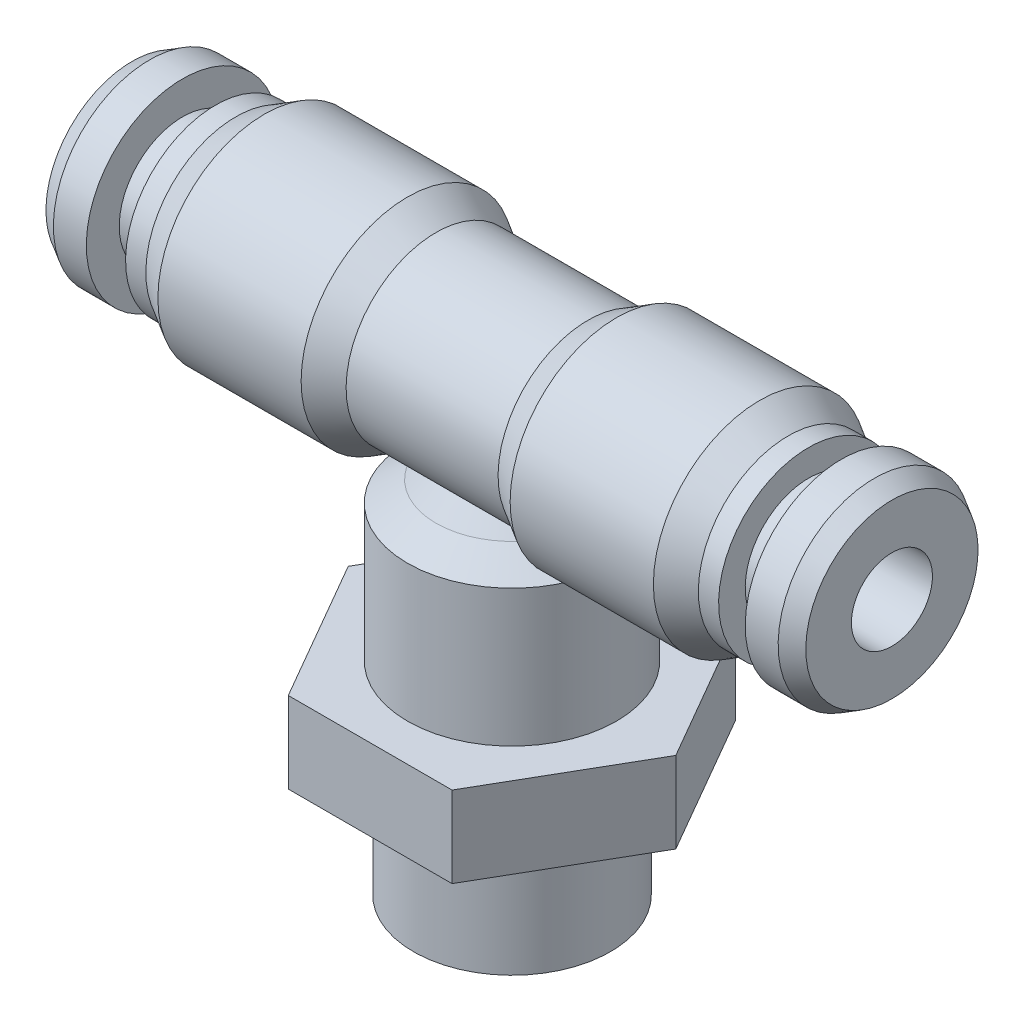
ISO-10303-21;
HEADER;
FILE_DESCRIPTION(('STEP AP214'),'2;1');
FILE_NAME('part.step','',(''),(''),'','','');
FILE_SCHEMA(('AUTOMOTIVE_DESIGN { 1 0 10303 214 1 1 1 1 }'));
ENDSEC;
DATA;
#1=APPLICATION_CONTEXT('core data for automotive mechanical design processes');
#2=APPLICATION_PROTOCOL_DEFINITION('international standard','automotive_design',2000,#1);
#3=PRODUCT_CONTEXT('',#1,'mechanical');
#4=PRODUCT('Part','Part','',(#3));
#5=PRODUCT_RELATED_PRODUCT_CATEGORY('part','',(#4));
#6=PRODUCT_DEFINITION_FORMATION('','',#4);
#7=PRODUCT_DEFINITION_CONTEXT('part definition',#1,'design');
#8=PRODUCT_DEFINITION('design','',#6,#7);
#9=PRODUCT_DEFINITION_SHAPE('','',#8);
#10=(LENGTH_UNIT() NAMED_UNIT(*) SI_UNIT(.MILLI.,.METRE.));
#11=(NAMED_UNIT(*) PLANE_ANGLE_UNIT() SI_UNIT($,.RADIAN.));
#12=(NAMED_UNIT(*) SI_UNIT($,.STERADIAN.) SOLID_ANGLE_UNIT());
#13=UNCERTAINTY_MEASURE_WITH_UNIT(LENGTH_MEASURE(1.E-05),#10,'distance_accuracy_value','');
#14=(GEOMETRIC_REPRESENTATION_CONTEXT(3) GLOBAL_UNCERTAINTY_ASSIGNED_CONTEXT((#13)) GLOBAL_UNIT_ASSIGNED_CONTEXT((#10,
#11,#12)) REPRESENTATION_CONTEXT('',''));
#15=CARTESIAN_POINT('',(0.,0.,0.));
#16=DIRECTION('',(0.,0.,1.));
#17=DIRECTION('',(1.,0.,0.));
#18=AXIS2_PLACEMENT_3D('',#15,#16,#17);
#19=CARTESIAN_POINT('',(9.,-12.,0.));
#20=DIRECTION('',(0.,-1.,0.));
#21=DIRECTION('',(1.,0.,0.));
#22=AXIS2_PLACEMENT_3D('',#19,#20,#21);
#23=PLANE('',#22);
#24=CARTESIAN_POINT('',(0.,-12.,0.));
#25=DIRECTION('',(0.,1.,0.));
#26=DIRECTION('',(-1.,0.,0.));
#27=AXIS2_PLACEMENT_3D('',#24,#25,#26);
#28=CIRCLE('',#27,5.15729128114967);
#29=CARTESIAN_POINT('',(-5.15729128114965,-12.,0.));
#30=VERTEX_POINT('',#29);
#31=EDGE_CURVE('E160',#30,#30,#28,.T.);
#32=ORIENTED_EDGE('',*,*,#31,.F.);
#33=EDGE_LOOP('',(#32));
#34=FACE_BOUND('',#33,.T.);
#35=DIRECTION('',(-0.5,0.,-0.866025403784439));
#36=VECTOR('',#35,1.);
#37=CARTESIAN_POINT('',(4.04145188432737,-12.,-7.00000000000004));
#38=LINE('',#37,#36);
#39=CARTESIAN_POINT('',(8.08290376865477,-12.,0.));
#40=VERTEX_POINT('',#39);
#41=CARTESIAN_POINT('',(4.04145188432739,-12.,-7.));
#42=VERTEX_POINT('',#41);
#43=EDGE_CURVE('E118',#40,#42,#38,.T.);
#44=ORIENTED_EDGE('',*,*,#43,.T.);
#45=DIRECTION('',(-1.,0.,0.));
#46=VECTOR('',#45,1.);
#47=CARTESIAN_POINT('',(-4.04145188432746,-12.,-7.));
#48=LINE('',#47,#46);
#49=CARTESIAN_POINT('',(-4.04145188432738,-12.,-7.));
#50=VERTEX_POINT('',#49);
#51=EDGE_CURVE('E156',#42,#50,#48,.T.);
#52=ORIENTED_EDGE('',*,*,#51,.T.);
#53=DIRECTION('',(-0.5,0.,0.866025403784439));
#54=VECTOR('',#53,1.);
#55=CARTESIAN_POINT('',(-8.08290376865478,-12.,0.));
#56=LINE('',#55,#54);
#57=CARTESIAN_POINT('',(-8.08290376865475,-12.,0.));
#58=VERTEX_POINT('',#57);
#59=EDGE_CURVE('E390',#50,#58,#56,.T.);
#60=ORIENTED_EDGE('',*,*,#59,.T.);
#61=DIRECTION('',(0.5,0.,0.866025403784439));
#62=VECTOR('',#61,1.);
#63=CARTESIAN_POINT('',(-4.04145188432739,-12.,6.99999999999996));
#64=LINE('',#63,#62);
#65=CARTESIAN_POINT('',(-4.04145188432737,-12.,7.));
#66=VERTEX_POINT('',#65);
#67=EDGE_CURVE('E387',#58,#66,#64,.T.);
#68=ORIENTED_EDGE('',*,*,#67,.T.);
#69=DIRECTION('',(1.,0.,0.));
#70=VECTOR('',#69,1.);
#71=CARTESIAN_POINT('',(4.0414518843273,-12.,7.));
#72=LINE('',#71,#70);
#73=CARTESIAN_POINT('',(4.04145188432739,-12.,7.));
#74=VERTEX_POINT('',#73);
#75=EDGE_CURVE('E384',#66,#74,#72,.T.);
#76=ORIENTED_EDGE('',*,*,#75,.T.);
#77=DIRECTION('',(0.5,0.,-0.866025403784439));
#78=VECTOR('',#77,1.);
#79=CARTESIAN_POINT('',(8.08290376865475,-12.,0.));
#80=LINE('',#79,#78);
#81=EDGE_CURVE('E161',#74,#40,#80,.T.);
#82=ORIENTED_EDGE('',*,*,#81,.T.);
#83=EDGE_LOOP('',(#44,#52,#60,#68,#76,#82));
#84=FACE_BOUND('',#83,.T.);
#85=ADVANCED_FACE('F16',(#34,#84),#23,.F.);
#86=CARTESIAN_POINT('',(-18.75,0.,0.));
#87=DIRECTION('',(-1.,0.,0.));
#88=DIRECTION('',(0.,-1.,0.));
#89=AXIS2_PLACEMENT_3D('',#86,#87,#88);
#90=CYLINDRICAL_SURFACE('',#89,1.99999999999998);
#91=CARTESIAN_POINT('',(-18.75,0.,0.));
#92=DIRECTION('',(-1.,0.,0.));
#93=DIRECTION('',(0.,-1.,0.));
#94=AXIS2_PLACEMENT_3D('',#91,#92,#93);
#95=CIRCLE('',#94,2.);
#96=CARTESIAN_POINT('',(-18.75,-2.,0.));
#97=VERTEX_POINT('',#96);
#98=EDGE_CURVE('E469',#97,#97,#95,.T.);
#99=ORIENTED_EDGE('',*,*,#98,.T.);
#100=EDGE_LOOP('',(#99));
#101=FACE_BOUND('',#100,.T.);
#102=CARTESIAN_POINT('',(-1.54979999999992,-1.89601739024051,-0.636488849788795));
#103=CARTESIAN_POINT('',(-1.58401190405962,-1.91172674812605,-0.58979126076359));
#104=CARTESIAN_POINT('',(-1.61526033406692,-1.92639014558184,-0.540291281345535));
#105=CARTESIAN_POINT('',(-1.67040558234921,-1.9526144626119,-0.436091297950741));
#106=CARTESIAN_POINT('',(-1.69424064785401,-1.96414922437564,-0.381352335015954));
#107=CARTESIAN_POINT('',(-1.73267019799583,-1.98288489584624,-0.267432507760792));
#108=CARTESIAN_POINT('',(-1.74719301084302,-1.99005217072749,-0.208221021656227));
#109=CARTESIAN_POINT('',(-1.76522390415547,-1.99896625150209,-0.0879752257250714));
#110=CARTESIAN_POINT('',(-1.76878237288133,-2.00073785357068,-0.0269505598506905));
#111=CARTESIAN_POINT('',(-1.7649587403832,-1.99884211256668,0.0855742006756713));
#112=CARTESIAN_POINT('',(-1.75911734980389,-1.99594065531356,0.137147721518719));
#113=CARTESIAN_POINT('',(-1.73973529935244,-1.98637831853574,0.238532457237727));
#114=CARTESIAN_POINT('',(-1.72618204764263,-1.97971129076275,0.28834064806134));
#115=CARTESIAN_POINT('',(-1.69221486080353,-1.9631749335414,0.385193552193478));
#116=CARTESIAN_POINT('',(-1.67177136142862,-1.95329181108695,0.432225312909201));
#117=CARTESIAN_POINT('',(-1.62514493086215,-1.93106942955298,0.522624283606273));
#118=CARTESIAN_POINT('',(-1.5989688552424,-1.91873310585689,0.565995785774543));
#119=CARTESIAN_POINT('',(-1.56369064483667,-1.90240680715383,0.617215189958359));
#120=CARTESIAN_POINT('',(-1.55680767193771,-1.89923391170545,0.626907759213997));
#121=CARTESIAN_POINT('',(-1.54979999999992,-1.89601739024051,0.636488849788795));
#122=B_SPLINE_CURVE_WITH_KNOTS('',3,(#102,#103,#104,#105,#106,#107,#108,#109,#110,#111,#112,
#113,#114,#115,#116,#117,#118,#119,#120,#121),.UNSPECIFIED.,.F.,.F.,(4,2,2,2,2,2,2,2,2,4),(0.,
0.180140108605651,0.361742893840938,0.544727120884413,0.726869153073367,0.882064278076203,
1.03751353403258,1.19363845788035,1.3495776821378,1.38648294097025),.UNSPECIFIED.);
#123=CARTESIAN_POINT('',(-1.74999999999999,-1.99144254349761,-0.184815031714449));
#124=VERTEX_POINT('',#123);
#125=CARTESIAN_POINT('',(-1.74999999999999,-1.99144254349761,0.184815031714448));
#126=VERTEX_POINT('',#125);
#127=EDGE_CURVE('E299',#124,#126,#122,.T.);
#128=ORIENTED_EDGE('',*,*,#127,.F.);
#129=CARTESIAN_POINT('',(-1.74999999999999,0.,0.));
#130=DIRECTION('',(-1.,0.,0.));
#131=DIRECTION('',(0.,-1.,0.));
#132=AXIS2_PLACEMENT_3D('',#129,#130,#131);
#133=CIRCLE('',#132,1.99999999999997);
#134=EDGE_CURVE('E467',#126,#124,#133,.T.);
#135=ORIENTED_EDGE('',*,*,#134,.F.);
#136=EDGE_LOOP('',(#128,#135));
#137=FACE_BOUND('',#136,.T.);
#138=ADVANCED_FACE('F308',(#101,#137),#90,.F.);
#139=CARTESIAN_POINT('',(-1.74999999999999,1.99999999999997,0.));
#140=DIRECTION('',(1.,0.,0.));
#141=DIRECTION('',(0.,1.,0.));
#142=AXIS2_PLACEMENT_3D('',#139,#140,#141);
#143=PLANE('',#142);
#144=CARTESIAN_POINT('',(-1.74999999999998,-3.82354835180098,2.89013624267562));
#145=CARTESIAN_POINT('',(-1.74999999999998,-3.73974675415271,2.80352883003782));
#146=CARTESIAN_POINT('',(-1.74999999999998,-3.65642402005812,2.71644689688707));
#147=CARTESIAN_POINT('',(-1.74999999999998,-3.49107461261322,2.54094295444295));
#148=CARTESIAN_POINT('',(-1.74999999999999,-3.40904892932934,2.45252001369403));
#149=CARTESIAN_POINT('',(-1.74999999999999,-3.24347978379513,2.27046669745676));
#150=CARTESIAN_POINT('',(-1.74999999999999,-3.16000871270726,2.17677019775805));
#151=CARTESIAN_POINT('',(-1.74999999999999,-2.99572364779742,1.98713312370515));
#152=CARTESIAN_POINT('',(-1.74999999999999,-2.91490850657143,1.89119354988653));
#153=CARTESIAN_POINT('',(-1.74999999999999,-2.75683359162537,1.69604928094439));
#154=CARTESIAN_POINT('',(-1.74999999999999,-2.67958229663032,1.59683767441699));
#155=CARTESIAN_POINT('',(-1.74999999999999,-2.53050887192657,1.39410164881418));
#156=CARTESIAN_POINT('',(-1.74999999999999,-2.45869504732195,1.29057099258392));
#157=CARTESIAN_POINT('',(-1.74999999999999,-2.35811004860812,1.13194986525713));
#158=CARTESIAN_POINT('',(-1.74999999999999,-2.32601354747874,1.0789840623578));
#159=CARTESIAN_POINT('',(-1.74999999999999,-2.26452805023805,0.971509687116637));
#160=CARTESIAN_POINT('',(-1.74999999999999,-2.23513965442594,0.917000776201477));
#161=CARTESIAN_POINT('',(-1.74999999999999,-2.15225327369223,0.751181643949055));
#162=CARTESIAN_POINT('',(-1.74999999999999,-2.10374969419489,0.637151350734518));
#163=CARTESIAN_POINT('',(-1.74999999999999,-2.05160713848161,0.475291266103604));
#164=CARTESIAN_POINT('',(-1.74999999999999,-2.03882135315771,0.430370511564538));
#165=CARTESIAN_POINT('',(-1.74999999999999,-2.01676190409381,0.339649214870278));
#166=CARTESIAN_POINT('',(-1.74999999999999,-2.00748891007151,0.29384850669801));
#167=CARTESIAN_POINT('',(-1.74999999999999,-1.99287449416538,0.201710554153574));
#168=CARTESIAN_POINT('',(-1.74999999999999,-1.9875254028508,0.155374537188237));
#169=CARTESIAN_POINT('',(-1.74999999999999,-1.98099446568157,0.0624256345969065));
#170=CARTESIAN_POINT('',(-1.74999999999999,-1.97981037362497,0.0158129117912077));
#171=CARTESIAN_POINT('',(-1.74999999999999,-1.9813329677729,-0.0608759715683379));
#172=CARTESIAN_POINT('',(-1.74999999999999,-1.98281389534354,-0.0909819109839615));
#173=CARTESIAN_POINT('',(-1.74999999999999,-1.98750243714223,-0.151036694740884));
#174=CARTESIAN_POINT('',(-1.74999999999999,-1.99070883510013,-0.18098563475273));
#175=CARTESIAN_POINT('',(-1.74999999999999,-2.00210804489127,-0.26518264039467));
#176=CARTESIAN_POINT('',(-1.74999999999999,-2.01223327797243,-0.319177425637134));
#177=CARTESIAN_POINT('',(-1.74999999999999,-2.03740848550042,-0.426025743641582));
#178=CARTESIAN_POINT('',(-1.74999999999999,-2.05246273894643,-0.478878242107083));
#179=CARTESIAN_POINT('',(-1.74999999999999,-2.08683216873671,-0.583471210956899));
#180=CARTESIAN_POINT('',(-1.74999999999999,-2.10616934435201,-0.63520436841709));
#181=CARTESIAN_POINT('',(-1.74999999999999,-2.14830855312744,-0.737205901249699));
#182=CARTESIAN_POINT('',(-1.74999999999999,-2.17110972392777,-0.787474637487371));
#183=CARTESIAN_POINT('',(-1.74999999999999,-2.22933051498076,-0.906709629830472));
#184=CARTESIAN_POINT('',(-1.74999999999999,-2.2661207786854,-0.97500355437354));
#185=CARTESIAN_POINT('',(-1.74999999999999,-2.34383248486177,-1.10921782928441));
#186=CARTESIAN_POINT('',(-1.74999999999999,-2.38475655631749,-1.17513663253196));
#187=CARTESIAN_POINT('',(-1.74999999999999,-2.4697762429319,-1.30507777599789));
#188=CARTESIAN_POINT('',(-1.74999999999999,-2.51387829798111,-1.36909587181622));
#189=CARTESIAN_POINT('',(-1.74999999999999,-2.60444015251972,-1.4954449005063));
#190=CARTESIAN_POINT('',(-1.74999999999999,-2.65090029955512,-1.55777558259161));
#191=CARTESIAN_POINT('',(-1.74999999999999,-2.74625849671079,-1.68183886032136));
#192=CARTESIAN_POINT('',(-1.74999999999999,-2.79518047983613,-1.74355298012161));
#193=CARTESIAN_POINT('',(-1.74999999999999,-2.89449013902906,-1.86579063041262));
#194=CARTESIAN_POINT('',(-1.74999999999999,-2.94487788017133,-1.92631410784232));
#195=CARTESIAN_POINT('',(-1.74999999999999,-3.0467459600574,-2.04628135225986));
#196=CARTESIAN_POINT('',(-1.74999999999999,-3.09822461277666,-2.10572655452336));
#197=CARTESIAN_POINT('',(-1.74999999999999,-3.20212398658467,-2.22378189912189));
#198=CARTESIAN_POINT('',(-1.74999999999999,-3.25454467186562,-2.28239207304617));
#199=CARTESIAN_POINT('',(-1.74999999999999,-3.4395204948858,-2.48649522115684));
#200=CARTESIAN_POINT('',(-1.74999999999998,-3.57409006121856,-2.63016192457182));
#201=CARTESIAN_POINT('',(-1.74999999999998,-3.84628518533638,-2.91457752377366));
#202=CARTESIAN_POINT('',(-1.74999999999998,-3.98391112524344,-3.05532605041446));
#203=CARTESIAN_POINT('',(-1.74999999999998,-4.2612977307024,-3.33479552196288));
#204=CARTESIAN_POINT('',(-1.74999999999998,-4.40105911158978,-3.47351575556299));
#205=CARTESIAN_POINT('',(-1.74999999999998,-4.68206937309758,-3.74944341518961));
#206=CARTESIAN_POINT('',(-1.74999999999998,-4.8233182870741,-3.88665080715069));
#207=CARTESIAN_POINT('',(-1.74999999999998,-5.10717229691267,-4.16017764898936));
#208=CARTESIAN_POINT('',(-1.74999999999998,-5.24977940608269,-4.29649500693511));
#209=CARTESIAN_POINT('',(-1.74999999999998,-5.53583090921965,-4.56824895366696));
#210=CARTESIAN_POINT('',(-1.74999999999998,-5.6792753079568,-4.70368553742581));
#211=CARTESIAN_POINT('',(-1.74999999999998,-6.11050980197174,-5.10891051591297));
#212=CARTESIAN_POINT('',(-1.74999999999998,-6.39926311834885,-5.37767344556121));
#213=CARTESIAN_POINT('',(-1.74999999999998,-6.94495110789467,-5.88249078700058));
#214=CARTESIAN_POINT('',(-1.74999999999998,-7.20170847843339,-6.11873740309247));
#215=CARTESIAN_POINT('',(-1.74999999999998,-7.71615354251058,-6.59024925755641));
#216=CARTESIAN_POINT('',(-1.74999999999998,-7.97384129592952,-6.82551443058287));
#217=CARTESIAN_POINT('',(-1.74999999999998,-8.48912385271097,-7.29462124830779));
#218=CARTESIAN_POINT('',(-1.74999999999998,-8.74671669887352,-7.52846504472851));
#219=CARTESIAN_POINT('',(-1.74999999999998,-9.26239507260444,-7.99557101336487));
#220=CARTESIAN_POINT('',(-1.74999999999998,-9.5204805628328,-8.22883322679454));
#221=CARTESIAN_POINT('',(-1.74999999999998,-9.77874639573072,-8.46189494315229));
#222=B_SPLINE_CURVE_WITH_KNOTS('',3,(#144,#145,#146,#147,#148,#149,#150,#151,#152,#153,#154,
#155,#156,#157,#158,#159,#160,#161,#162,#163,#164,#165,#166,#167,#168,#169,#170,#171,#172,#173,
#174,#175,#176,#177,#178,#179,#180,#181,#182,#183,#184,#185,#186,#187,#188,#189,#190,#191,#192,
#193,#194,#195,#196,#197,#198,#199,#200,#201,#202,#203,#204,#205,#206,#207,#208,#209,#210,#211,
#212,#213,#214,#215,#216,#217,#218,#219,#220,#221),.UNSPECIFIED.,.F.,.F.,(4,2,2,2,2,2,2,2,2,2,2,
2,2,2,2,2,2,2,2,2,2,2,2,2,2,2,2,2,2,2,2,2,2,2,2,2,2,2,4),(0.,0.361551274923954,
0.723366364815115,1.09978676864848,1.47604235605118,1.85315123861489,2.23082495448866,
2.41654232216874,2.60230075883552,2.97228296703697,3.11228670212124,3.25231711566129,
3.39207309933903,3.53175370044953,3.62213333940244,3.71244935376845,3.87697303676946,
4.04163992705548,4.20717309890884,4.37266512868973,4.60517765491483,4.83783899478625,
5.07098583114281,5.30416713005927,5.54039728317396,5.77663794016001,6.01253684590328,
6.24842680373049,6.83888633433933,7.42942010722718,8.02015623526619,8.61090563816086,
9.20273929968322,9.7945763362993,10.9779931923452,12.0247147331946,13.0715048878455,
14.1152151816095,15.1588492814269),.UNSPECIFIED.);
#223=EDGE_CURVE('E293',#126,#124,#222,.T.);
#224=ORIENTED_EDGE('',*,*,#223,.F.);
#225=ORIENTED_EDGE('',*,*,#134,.T.);
#226=EDGE_LOOP('',(#224,#225));
#227=FACE_BOUND('',#226,.T.);
#228=ADVANCED_FACE('F305',(#227),#143,.F.);
#229=CARTESIAN_POINT('',(1.74999999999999,1.99999999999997,0.));
#230=DIRECTION('',(-1.,0.,0.));
#231=DIRECTION('',(0.,-1.,0.));
#232=AXIS2_PLACEMENT_3D('',#229,#230,#231);
#233=PLANE('',#232);
#234=CARTESIAN_POINT('',(1.74999999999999,-9.77874639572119,-8.46189494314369));
#235=CARTESIAN_POINT('',(1.74999999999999,-9.59967250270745,-8.30030600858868));
#236=CARTESIAN_POINT('',(1.74999999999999,-9.42069053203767,-8.13861513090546));
#237=CARTESIAN_POINT('',(1.74999999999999,-9.06295200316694,-7.81498347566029));
#238=CARTESIAN_POINT('',(1.74999999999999,-8.88419544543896,-7.65304269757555));
#239=CARTESIAN_POINT('',(1.74999999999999,-8.34829382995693,-7.1667470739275));
#240=CARTESIAN_POINT('',(1.74999999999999,-7.99155046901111,-6.84194926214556));
#241=CARTESIAN_POINT('',(1.74999999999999,-7.27893657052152,-6.18995110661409));
#242=CARTESIAN_POINT('',(1.74999999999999,-6.9230692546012,-5.862747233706));
#243=CARTESIAN_POINT('',(1.74999999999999,-6.39123030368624,-5.36984101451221));
#244=CARTESIAN_POINT('',(1.74999999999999,-6.21428203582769,-5.20519299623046));
#245=CARTESIAN_POINT('',(1.74999999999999,-5.86125140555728,-4.87497199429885));
#246=CARTESIAN_POINT('',(1.74999999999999,-5.68516903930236,-4.70939901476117));
#247=CARTESIAN_POINT('',(1.74999999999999,-5.33296438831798,-4.37588605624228));
#248=CARTESIAN_POINT('',(1.74999999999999,-5.15685008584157,-4.20793763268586));
#249=CARTESIAN_POINT('',(1.74999999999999,-4.80625850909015,-3.8703122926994));
#250=CARTESIAN_POINT('',(1.74999999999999,-4.63178135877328,-3.70063524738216));
#251=CARTESIAN_POINT('',(1.74999999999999,-4.28528021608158,-3.35890076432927));
#252=CARTESIAN_POINT('',(1.74999999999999,-4.1132553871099,-3.18684417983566));
#253=CARTESIAN_POINT('',(1.74999999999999,-3.8580342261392,-2.92602363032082));
#254=CARTESIAN_POINT('',(1.74999999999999,-3.77343534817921,-2.83863336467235));
#255=CARTESIAN_POINT('',(1.74999999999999,-3.6054474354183,-2.66269918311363));
#256=CARTESIAN_POINT('',(1.74999999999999,-3.52205837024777,-2.57415529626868));
#257=CARTESIAN_POINT('',(1.74999999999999,-3.35288779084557,-2.39131858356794));
#258=CARTESIAN_POINT('',(1.74999999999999,-3.26718370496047,-2.29695388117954));
#259=CARTESIAN_POINT('',(1.74999999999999,-3.09811067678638,-2.10610643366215));
#260=CARTESIAN_POINT('',(1.74999999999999,-3.01474225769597,-2.00962322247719));
#261=CARTESIAN_POINT('',(1.74999999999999,-2.85119994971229,-1.81370753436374));
#262=CARTESIAN_POINT('',(1.74999999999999,-2.77103137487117,-1.7142705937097));
#263=CARTESIAN_POINT('',(1.74999999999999,-2.61560935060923,-1.51164566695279));
#264=CARTESIAN_POINT('',(1.74999999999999,-2.54035352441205,-1.40845953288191));
#265=CARTESIAN_POINT('',(1.74999999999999,-2.42764083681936,-1.24163604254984));
#266=CARTESIAN_POINT('',(1.74999999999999,-2.38765704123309,-1.17972622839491));
#267=CARTESIAN_POINT('',(1.74999999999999,-2.31103674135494,-1.05387806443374));
#268=CARTESIAN_POINT('',(1.74999999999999,-2.27440146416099,-0.989938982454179));
#269=CARTESIAN_POINT('',(1.74999999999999,-2.17139710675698,-0.795137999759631));
#270=CARTESIAN_POINT('',(1.74999999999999,-2.11138573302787,-0.660533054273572));
#271=CARTESIAN_POINT('',(1.74999999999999,-2.05004568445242,-0.470558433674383));
#272=CARTESIAN_POINT('',(1.74999999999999,-2.03569329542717,-0.419367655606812));
#273=CARTESIAN_POINT('',(1.74999999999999,-2.01160885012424,-0.315843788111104));
#274=CARTESIAN_POINT('',(1.74999999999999,-2.00188020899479,-0.263509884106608));
#275=CARTESIAN_POINT('',(1.74999999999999,-1.98870297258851,-0.166161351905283));
#276=CARTESIAN_POINT('',(1.74999999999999,-1.98452379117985,-0.121245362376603));
#277=CARTESIAN_POINT('',(1.74999999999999,-1.98009022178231,-0.0312089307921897));
#278=CARTESIAN_POINT('',(1.74999999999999,-1.97983640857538,0.0139115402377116));
#279=CARTESIAN_POINT('',(1.74999999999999,-1.98326770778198,0.103968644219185));
#280=CARTESIAN_POINT('',(1.74999999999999,-1.98695004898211,0.148905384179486));
#281=CARTESIAN_POINT('',(1.74999999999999,-1.99807632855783,0.238326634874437));
#282=CARTESIAN_POINT('',(1.74999999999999,-2.00552227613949,0.282810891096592));
#283=CARTESIAN_POINT('',(1.74999999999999,-2.02698956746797,0.386099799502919));
#284=CARTESIAN_POINT('',(1.74999999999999,-2.04238693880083,0.444618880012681));
#285=CARTESIAN_POINT('',(1.74999999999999,-2.07841627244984,0.560030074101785));
#286=CARTESIAN_POINT('',(1.74999999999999,-2.09905187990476,0.616921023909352));
#287=CARTESIAN_POINT('',(1.74999999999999,-2.14483609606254,0.729644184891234));
#288=CARTESIAN_POINT('',(1.74999999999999,-2.17003662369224,0.785455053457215));
#289=CARTESIAN_POINT('',(1.74999999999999,-2.22387599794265,0.895349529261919));
#290=CARTESIAN_POINT('',(1.74999999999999,-2.25251374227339,0.949433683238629));
#291=CARTESIAN_POINT('',(1.74999999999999,-2.33446993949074,1.09511945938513));
#292=CARTESIAN_POINT('',(1.74999999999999,-2.39050315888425,1.1851880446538));
#293=CARTESIAN_POINT('',(1.74999999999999,-2.50804423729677,1.3617036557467));
#294=CARTESIAN_POINT('',(1.74999999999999,-2.56955660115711,1.44814761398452));
#295=CARTESIAN_POINT('',(1.74999999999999,-2.69661667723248,1.61852498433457));
#296=CARTESIAN_POINT('',(1.74999999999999,-2.76217926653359,1.70244722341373));
#297=CARTESIAN_POINT('',(1.74999999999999,-2.89604087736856,1.86808286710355));
#298=CARTESIAN_POINT('',(1.74999999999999,-2.96434027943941,1.94979596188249));
#299=CARTESIAN_POINT('',(1.74999999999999,-3.09726604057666,2.10485292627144));
#300=CARTESIAN_POINT('',(1.74999999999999,-3.16173386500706,2.17833331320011));
#301=CARTESIAN_POINT('',(1.74999999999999,-3.29199285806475,2.32412197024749));
#302=CARTESIAN_POINT('',(1.74999999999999,-3.35778415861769,2.39643012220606));
#303=CARTESIAN_POINT('',(1.74999999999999,-3.4897846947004,2.53941603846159));
#304=CARTESIAN_POINT('',(1.74999999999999,-3.5559842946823,2.61010272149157));
#305=CARTESIAN_POINT('',(1.74999999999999,-3.68919875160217,2.75067624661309));
#306=CARTESIAN_POINT('',(1.74999999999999,-3.75621343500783,2.82056325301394));
#307=CARTESIAN_POINT('',(1.74999999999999,-3.82354835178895,2.89013624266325));
#308=B_SPLINE_CURVE_WITH_KNOTS('',3,(#234,#235,#236,#237,#238,#239,#240,#241,#242,#243,#244,
#245,#246,#247,#248,#249,#250,#251,#252,#253,#254,#255,#256,#257,#258,#259,#260,#261,#262,#263,
#264,#265,#266,#267,#268,#269,#270,#271,#272,#273,#274,#275,#276,#277,#278,#279,#280,#281,#282,
#283,#284,#285,#286,#287,#288,#289,#290,#291,#292,#293,#294,#295,#296,#297,#298,#299,#300,#301,
#302,#303,#304,#305,#306,#307),.UNSPECIFIED.,.F.,.F.,(4,2,2,2,2,2,2,2,2,2,2,2,2,2,2,2,2,2,2,2,2,
2,2,2,2,2,2,2,2,2,2,2,2,2,2,2,4),(0.,0.723606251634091,1.44721401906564,2.89456542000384,
4.34484226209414,5.06994459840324,5.79504371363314,6.52510776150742,7.25522664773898,
7.98509019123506,8.3499737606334,8.71484815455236,9.09724545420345,9.4797277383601,
9.86282082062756,10.2457271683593,10.4667148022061,10.6877830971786,11.1271289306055,
11.286453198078,11.4458949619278,11.5810636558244,11.7162521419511,11.8513455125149,
11.9865110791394,12.1677356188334,12.3490866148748,12.532647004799,12.7161486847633,
13.0340450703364,13.3522052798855,13.671613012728,13.9910653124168,14.2843022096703,
14.5775684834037,14.8680969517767,15.1585646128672),.UNSPECIFIED.);
#309=CARTESIAN_POINT('',(1.74999999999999,-1.99144254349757,-0.184815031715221));
#310=VERTEX_POINT('',#309);
#311=CARTESIAN_POINT('',(1.74999999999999,-1.99144254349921,0.184815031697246));
#312=VERTEX_POINT('',#311);
#313=EDGE_CURVE('E287',#310,#312,#308,.T.);
#314=ORIENTED_EDGE('',*,*,#313,.F.);
#315=CARTESIAN_POINT('',(1.74999999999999,0.,0.));
#316=DIRECTION('',(-1.,0.,0.));
#317=DIRECTION('',(0.,-1.,0.));
#318=AXIS2_PLACEMENT_3D('',#315,#316,#317);
#319=CIRCLE('',#318,1.99999999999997);
#320=EDGE_CURVE('E465',#312,#310,#319,.T.);
#321=ORIENTED_EDGE('',*,*,#320,.F.);
#322=EDGE_LOOP('',(#314,#321));
#323=FACE_BOUND('',#322,.T.);
#324=ADVANCED_FACE('F277',(#323),#233,.F.);
#325=CARTESIAN_POINT('',(-18.75,0.,0.));
#326=DIRECTION('',(-1.,0.,0.));
#327=DIRECTION('',(0.,-1.,0.));
#328=AXIS2_PLACEMENT_3D('',#325,#326,#327);
#329=CYLINDRICAL_SURFACE('',#328,1.99999999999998);
#330=CARTESIAN_POINT('',(18.75,0.,0.));
#331=DIRECTION('',(-1.,0.,0.));
#332=DIRECTION('',(0.,-1.,0.));
#333=AXIS2_PLACEMENT_3D('',#330,#331,#332);
#334=CIRCLE('',#333,1.99999999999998);
#335=CARTESIAN_POINT('',(18.75,-1.99999999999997,0.));
#336=VERTEX_POINT('',#335);
#337=EDGE_CURVE('E462',#336,#336,#334,.T.);
#338=ORIENTED_EDGE('',*,*,#337,.F.);
#339=EDGE_LOOP('',(#338));
#340=FACE_BOUND('',#339,.T.);
#341=CARTESIAN_POINT('',(1.54979999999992,-1.89601739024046,0.636488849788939));
#342=CARTESIAN_POINT('',(1.58401190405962,-1.911726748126,0.589791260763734));
#343=CARTESIAN_POINT('',(1.61526033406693,-1.9263901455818,0.540291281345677));
#344=CARTESIAN_POINT('',(1.67040558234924,-1.95261446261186,0.436091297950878));
#345=CARTESIAN_POINT('',(1.69424064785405,-1.9641492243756,0.381352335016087));
#346=CARTESIAN_POINT('',(1.7326701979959,-1.98288489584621,0.267432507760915));
#347=CARTESIAN_POINT('',(1.74719301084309,-1.99005217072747,0.208221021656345));
#348=CARTESIAN_POINT('',(1.76522390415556,-1.99896625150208,0.0879752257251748));
#349=CARTESIAN_POINT('',(1.76878237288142,-2.00073785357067,0.026950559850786));
#350=CARTESIAN_POINT('',(1.76495874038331,-1.99884211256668,-0.0855742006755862));
#351=CARTESIAN_POINT('',(1.759117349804,-1.99594065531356,-0.137147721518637));
#352=CARTESIAN_POINT('',(1.73973529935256,-1.98637831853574,-0.23853245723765));
#353=CARTESIAN_POINT('',(1.72618204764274,-1.97971129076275,-0.288340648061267));
#354=CARTESIAN_POINT('',(1.69221486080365,-1.96317493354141,-0.385193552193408));
#355=CARTESIAN_POINT('',(1.67177136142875,-1.95329181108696,-0.432225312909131));
#356=CARTESIAN_POINT('',(1.62514493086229,-1.93106942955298,-0.522624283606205));
#357=CARTESIAN_POINT('',(1.59896885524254,-1.9187331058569,-0.565995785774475));
#358=CARTESIAN_POINT('',(1.56369064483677,-1.90240680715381,-0.617215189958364));
#359=CARTESIAN_POINT('',(1.55680767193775,-1.89923391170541,-0.626907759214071));
#360=CARTESIAN_POINT('',(1.54979999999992,-1.89601739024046,-0.636488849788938));
#361=B_SPLINE_CURVE_WITH_KNOTS('',3,(#341,#342,#343,#344,#345,#346,#347,#348,#349,#350,#351,
#352,#353,#354,#355,#356,#357,#358,#359,#360),.UNSPECIFIED.,.F.,.F.,(4,2,2,2,2,2,2,2,2,4),(0.,
0.180140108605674,0.361742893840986,0.544727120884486,0.726869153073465,0.882064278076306,
1.03751353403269,1.19363845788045,1.3495776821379,1.38648294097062),.UNSPECIFIED.);
#362=EDGE_CURVE('E281',#312,#310,#361,.T.);
#363=ORIENTED_EDGE('',*,*,#362,.F.);
#364=ORIENTED_EDGE('',*,*,#320,.T.);
#365=EDGE_LOOP('',(#363,#364));
#366=FACE_BOUND('',#365,.T.);
#367=ADVANCED_FACE('F234',(#340,#366),#329,.F.);
#368=CARTESIAN_POINT('',(5.1572912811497,0.,0.));
#369=DIRECTION('',(1.,0.,0.));
#370=DIRECTION('',(0.,1.,0.));
#371=AXIS2_PLACEMENT_3D('',#368,#369,#370);
#372=CONICAL_SURFACE('',#371,5.24999999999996,0.523598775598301);
#373=CARTESIAN_POINT('',(3.74980000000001,-4.33107790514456,-0.965476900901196));
#374=CARTESIAN_POINT('',(3.8137323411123,-4.3724797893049,-0.949371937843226));
#375=CARTESIAN_POINT('',(3.87745546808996,-4.41380470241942,-0.932155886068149));
#376=CARTESIAN_POINT('',(4.00440627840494,-4.49623674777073,-0.895054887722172));
#377=CARTESIAN_POINT('',(4.06763305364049,-4.5373434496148,-0.875165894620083));
#378=CARTESIAN_POINT('',(4.19312482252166,-4.619022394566,-0.832384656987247));
#379=CARTESIAN_POINT('',(4.2553921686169,-4.65959588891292,-0.809501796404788));
#380=CARTESIAN_POINT('',(4.3788255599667,-4.74010454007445,-0.76005216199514));
#381=CARTESIAN_POINT('',(4.4399923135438,-4.78004010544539,-0.733487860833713));
#382=CARTESIAN_POINT('',(4.55266325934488,-4.85366658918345,-0.679558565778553));
#383=CARTESIAN_POINT('',(4.60436532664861,-4.88747813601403,-0.652776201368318));
#384=CARTESIAN_POINT('',(4.70625682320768,-4.95415695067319,-0.594550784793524));
#385=CARTESIAN_POINT('',(4.75643711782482,-4.98701847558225,-0.563084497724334));
#386=CARTESIAN_POINT('',(4.85448430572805,-5.05126455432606,-0.493553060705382));
#387=CARTESIAN_POINT('',(4.9023069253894,-5.08262066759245,-0.455398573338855));
#388=CARTESIAN_POINT('',(4.9919464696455,-5.14142486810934,-0.370170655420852));
#389=CARTESIAN_POINT('',(5.03381621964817,-5.16890730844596,-0.323185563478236));
#390=CARTESIAN_POINT('',(5.08138340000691,-5.2001400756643,-0.251287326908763));
#391=CARTESIAN_POINT('',(5.09287279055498,-5.20768518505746,-0.231942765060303));
#392=CARTESIAN_POINT('',(5.11364011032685,-5.22132450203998,-0.19158403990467));
#393=CARTESIAN_POINT('',(5.12291763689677,-5.22741844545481,-0.17056957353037));
#394=CARTESIAN_POINT('',(5.13863275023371,-5.23774164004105,-0.126719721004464));
#395=CARTESIAN_POINT('',(5.14503368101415,-5.24194682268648,-0.103864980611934));
#396=CARTESIAN_POINT('',(5.15404176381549,-5.24786497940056,-0.0571155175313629));
#397=CARTESIAN_POINT('',(5.15665638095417,-5.24958285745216,-0.0332229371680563));
#398=CARTESIAN_POINT('',(5.15766486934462,-5.25024545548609,0.0121688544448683));
#399=CARTESIAN_POINT('',(5.15647350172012,-5.24946268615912,0.0336556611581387));
#400=CARTESIAN_POINT('',(5.15091346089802,-5.24580972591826,0.0760359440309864));
#401=CARTESIAN_POINT('',(5.1465415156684,-5.24293738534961,0.0969287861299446));
#402=CARTESIAN_POINT('',(5.13370970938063,-5.23450762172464,0.142483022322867));
#403=CARTESIAN_POINT('',(5.12452061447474,-5.22847125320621,0.166845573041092));
#404=CARTESIAN_POINT('',(5.10303740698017,-5.21436071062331,0.213507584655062));
#405=CARTESIAN_POINT('',(5.09073722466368,-5.20628255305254,0.235802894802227));
#406=CARTESIAN_POINT('',(5.05450258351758,-5.18248929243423,0.293390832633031));
#407=CARTESIAN_POINT('',(5.02847627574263,-5.16540309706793,0.326775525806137));
#408=CARTESIAN_POINT('',(4.97279938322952,-5.1288638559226,0.388866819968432));
#409=CARTESIAN_POINT('',(4.94313722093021,-5.10940325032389,0.417557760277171));
#410=CARTESIAN_POINT('',(4.86843256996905,-5.06041006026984,0.482823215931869));
#411=CARTESIAN_POINT('',(4.82224572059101,-5.03013468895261,0.517508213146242));
#412=CARTESIAN_POINT('',(4.72732741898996,-4.96795448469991,0.581603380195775));
#413=CARTESIAN_POINT('',(4.67859062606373,-4.93604623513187,0.611001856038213));
#414=CARTESIAN_POINT('',(4.52949748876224,-4.8385013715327,0.693548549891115));
#415=CARTESIAN_POINT('',(4.42678305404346,-4.77138890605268,0.740648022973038));
#416=CARTESIAN_POINT('',(4.22811448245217,-4.64180040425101,0.820592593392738));
#417=CARTESIAN_POINT('',(4.1324096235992,-4.57946703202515,0.854351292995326));
#418=CARTESIAN_POINT('',(3.94119244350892,-4.45515365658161,0.914599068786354));
#419=CARTESIAN_POINT('',(3.845709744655,-4.39318870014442,0.941211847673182));
#420=CARTESIAN_POINT('',(3.74979999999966,-4.33107790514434,0.965476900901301));
#421=B_SPLINE_CURVE_WITH_KNOTS('',3,(#373,#374,#375,#376,#377,#378,#379,#380,#381,#382,#383,
#384,#385,#386,#387,#388,#389,#390,#391,#392,#393,#394,#395,#396,#397,#398,#399,#400,#401,#402,
#403,#404,#405,#406,#407,#408,#409,#410,#411,#412,#413,#414,#415,#416,#417,#418,#419,#420),
.UNSPECIFIED.,.F.,.F.,(4,2,2,2,2,2,2,2,2,2,2,2,2,2,2,2,2,2,2,2,2,2,2,4),(0.,0.233571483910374,
0.467500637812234,0.700713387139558,0.933770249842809,1.13564613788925,1.33855904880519,
1.54442382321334,1.74832935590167,1.81936164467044,1.89040685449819,1.96233335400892,
2.03411784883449,2.09835697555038,2.16266228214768,2.2423995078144,2.32229351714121,
2.45846821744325,2.59508838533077,2.79024720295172,2.98583254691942,3.37921457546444,
3.73634556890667,4.08682401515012),.UNSPECIFIED.);
#422=CARTESIAN_POINT('',(3.75000000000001,-4.33120742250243,-0.965426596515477));
#423=VERTEX_POINT('',#422);
#424=CARTESIAN_POINT('',(5.15729128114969,-5.24999999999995,0.));
#425=VERTEX_POINT('',#424);
#426=EDGE_CURVE('E500',#423,#425,#421,.T.);
#427=ORIENTED_EDGE('',*,*,#426,.F.);
#428=CARTESIAN_POINT('',(3.75,0.,0.));
#429=DIRECTION('',(-1.,0.,0.));
#430=DIRECTION('',(0.,-1.,0.));
#431=AXIS2_PLACEMENT_3D('',#428,#429,#430);
#432=CIRCLE('',#431,4.43749999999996);
#433=CARTESIAN_POINT('',(3.75000000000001,-4.33120742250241,0.965426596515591));
#434=VERTEX_POINT('',#433);
#435=EDGE_CURVE('E428',#434,#423,#432,.T.);
#436=ORIENTED_EDGE('',*,*,#435,.F.);
#437=EDGE_CURVE('E216',#425,#434,#421,.T.);
#438=ORIENTED_EDGE('',*,*,#437,.F.);
#439=CARTESIAN_POINT('',(5.1572912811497,0.,0.));
#440=DIRECTION('',(-1.,0.,0.));
#441=DIRECTION('',(0.,-1.,0.));
#442=AXIS2_PLACEMENT_3D('',#439,#440,#441);
#443=CIRCLE('',#442,5.24999999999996);
#444=EDGE_CURVE('E435',#425,#425,#443,.T.);
#445=ORIENTED_EDGE('',*,*,#444,.T.);
#446=EDGE_LOOP('',(#427,#436,#438,#445));
#447=FACE_BOUND('',#446,.T.);
#448=ADVANCED_FACE('F227',(#447),#372,.T.);
#449=CARTESIAN_POINT('',(-18.75,0.,0.));
#450=DIRECTION('',(-1.,0.,0.));
#451=DIRECTION('',(0.,-1.,0.));
#452=AXIS2_PLACEMENT_3D('',#449,#450,#451);
#453=CYLINDRICAL_SURFACE('',#452,4.43749999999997);
#454=CARTESIAN_POINT('',(-2.05734506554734,-3.78105881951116,2.32271402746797));
#455=CARTESIAN_POINT('',(-2.17329194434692,-3.81043342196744,2.27484069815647));
#456=CARTESIAN_POINT('',(-2.2871487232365,-3.84129257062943,2.22262186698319));
#457=CARTESIAN_POINT('',(-2.51008110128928,-3.90499933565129,2.1087275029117));
#458=CARTESIAN_POINT('',(-2.61913448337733,-3.93785479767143,2.0470129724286));
#459=CARTESIAN_POINT('',(-2.82992313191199,-4.0040120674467,1.91434744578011));
#460=CARTESIAN_POINT('',(-2.93171470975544,-4.0373073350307,1.84348319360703));
#461=CARTESIAN_POINT('',(-3.12727329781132,-4.10331495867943,1.69146994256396));
#462=CARTESIAN_POINT('',(-3.22105715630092,-4.13602841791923,1.61034347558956));
#463=CARTESIAN_POINT('',(-3.3636886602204,-4.18698772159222,1.47094610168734));
#464=CARTESIAN_POINT('',(-3.41574827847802,-4.20588118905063,1.41617036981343));
#465=CARTESIAN_POINT('',(-3.54529360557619,-4.25348777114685,1.26822770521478));
#466=CARTESIAN_POINT('',(-3.61936149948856,-4.28131461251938,1.17169519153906));
#467=CARTESIAN_POINT('',(-3.75249099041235,-4.33203588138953,0.967421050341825));
#468=CARTESIAN_POINT('',(-3.81155743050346,-4.35493190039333,0.859683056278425));
#469=CARTESIAN_POINT('',(-3.90003628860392,-4.38952741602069,0.657088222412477));
#470=CARTESIAN_POINT('',(-3.93303144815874,-4.40255529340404,0.564040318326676));
#471=CARTESIAN_POINT('',(-3.98411500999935,-4.42280125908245,0.373353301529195));
#472=CARTESIAN_POINT('',(-4.00222161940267,-4.43002644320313,0.275719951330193));
#473=CARTESIAN_POINT('',(-4.02199481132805,-4.43791922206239,0.0780663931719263));
#474=CARTESIAN_POINT('',(-4.02358886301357,-4.43855788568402,-0.0219624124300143));
#475=CARTESIAN_POINT('',(-4.00998418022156,-4.43312396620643,-0.220702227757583));
#476=CARTESIAN_POINT('',(-3.99477848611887,-4.42704860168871,-0.319412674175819));
#477=CARTESIAN_POINT('',(-3.95036589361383,-4.4094151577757,-0.506761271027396));
#478=CARTESIAN_POINT('',(-3.92204706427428,-4.39820526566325,-0.595649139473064));
#479=CARTESIAN_POINT('',(-3.85374445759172,-4.37139646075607,-0.768062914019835));
#480=CARTESIAN_POINT('',(-3.81375836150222,-4.3557966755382,-0.851587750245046));
#481=CARTESIAN_POINT('',(-3.72614184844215,-4.32199209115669,-1.00895497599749));
#482=CARTESIAN_POINT('',(-3.67892313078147,-4.30393137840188,-1.08306125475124));
#483=CARTESIAN_POINT('',(-3.57731942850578,-4.26557053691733,-1.22545816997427));
#484=CARTESIAN_POINT('',(-3.52293626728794,-4.24527097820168,-1.29375027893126));
#485=CARTESIAN_POINT('',(-3.35467815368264,-4.18343989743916,-1.48593237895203));
#486=CARTESIAN_POINT('',(-3.23272273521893,-4.1398033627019,-1.60210160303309));
#487=CARTESIAN_POINT('',(-2.97313304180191,-4.05078517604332,-1.81548303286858));
#488=CARTESIAN_POINT('',(-2.83542359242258,-4.00539590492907,-1.91259778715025));
#489=CARTESIAN_POINT('',(-2.59983377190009,-3.93209063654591,-2.05769213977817));
#490=CARTESIAN_POINT('',(-2.5052273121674,-3.90370668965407,-2.11085580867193));
#491=CARTESIAN_POINT('',(-2.31199932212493,-3.84830917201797,-2.21024070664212));
#492=CARTESIAN_POINT('',(-2.21337637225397,-3.82129609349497,-2.25645945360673));
#493=CARTESIAN_POINT('',(-2.01390047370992,-3.76965955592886,-2.34169425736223));
#494=CARTESIAN_POINT('',(-1.9130867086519,-3.74501199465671,-2.38078770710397));
#495=CARTESIAN_POINT('',(-1.70866925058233,-3.69842083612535,-2.45252717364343));
#496=CARTESIAN_POINT('',(-1.60506769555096,-3.67647523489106,-2.48517797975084));
#497=CARTESIAN_POINT('',(-1.50025972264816,-3.65619352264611,-2.51468788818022));
#498=B_SPLINE_CURVE_WITH_KNOTS('',3,(#454,#455,#456,#457,#458,#459,#460,#461,#462,#463,#464,
#465,#466,#467,#468,#469,#470,#471,#472,#473,#474,#475,#476,#477,#478,#479,#480,#481,#482,#483,
#484,#485,#486,#487,#488,#489,#490,#491,#492,#493,#494,#495,#496,#497),.UNSPECIFIED.,.F.,.F.,(4,
2,2,2,2,2,2,2,2,2,2,2,2,2,2,2,2,2,2,2,2,4),(0.,0.386518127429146,0.774668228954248,
1.15937690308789,1.54325510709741,1.7767629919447,2.14994591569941,2.5230082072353,
2.82053219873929,3.11769180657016,3.41615612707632,3.71474413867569,3.99554415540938,
4.27640001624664,4.54495017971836,4.81343212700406,5.33295258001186,5.85506449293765,
6.19130170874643,6.52765881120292,6.8601108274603,7.19231476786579),.UNSPECIFIED.);
#499=CARTESIAN_POINT('',(-3.7500000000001,-4.33120742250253,-0.965426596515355));
#500=VERTEX_POINT('',#499);
#501=CARTESIAN_POINT('',(-3.51862679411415,-4.24377671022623,-1.29682901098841));
#502=VERTEX_POINT('',#501);
#503=EDGE_CURVE('E187',#500,#502,#498,.T.);
#504=ORIENTED_EDGE('',*,*,#503,.F.);
#505=CARTESIAN_POINT('',(-3.75,0.,0.));
#506=DIRECTION('',(-1.,0.,0.));
#507=DIRECTION('',(0.,-1.,0.));
#508=AXIS2_PLACEMENT_3D('',#505,#506,#507);
#509=CIRCLE('',#508,4.43749999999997);
#510=CARTESIAN_POINT('',(-3.75,-4.33120742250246,0.965426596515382));
#511=VERTEX_POINT('',#510);
#512=EDGE_CURVE('E426',#511,#500,#509,.T.);
#513=ORIENTED_EDGE('',*,*,#512,.F.);
#514=CARTESIAN_POINT('',(-3.51862679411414,-4.24377671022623,1.29682901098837));
#515=VERTEX_POINT('',#514);
#516=EDGE_CURVE('E217',#515,#511,#498,.T.);
#517=ORIENTED_EDGE('',*,*,#516,.F.);
#518=CARTESIAN_POINT('',(-3.174178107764,-4.08841504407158,-1.72519148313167));
#519=CARTESIAN_POINT('',(-3.05207918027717,-4.03518453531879,-1.85134557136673));
#520=CARTESIAN_POINT('',(-2.91992106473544,-3.97959608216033,-1.96682209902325));
#521=CARTESIAN_POINT('',(-2.64025336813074,-3.86832409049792,-2.17754444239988));
#522=CARTESIAN_POINT('',(-2.49271330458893,-3.81264058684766,-2.27274890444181));
#523=CARTESIAN_POINT('',(-2.1558387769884,-3.69492430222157,-2.46037599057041));
#524=CARTESIAN_POINT('',(-1.96393166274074,-3.63373821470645,-2.54872080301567));
#525=CARTESIAN_POINT('',(-1.56655446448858,-3.52369470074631,-2.69882901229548));
#526=CARTESIAN_POINT('',(-1.36108373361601,-3.47483786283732,-2.76059114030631));
#527=CARTESIAN_POINT('',(-1.03109789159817,-3.41274744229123,-2.83651174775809));
#528=CARTESIAN_POINT('',(-0.909768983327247,-3.39322986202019,-2.85971965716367));
#529=CARTESIAN_POINT('',(-0.664804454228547,-3.36116773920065,-2.89734018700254));
#530=CARTESIAN_POINT('',(-0.541168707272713,-3.34862357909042,-2.91175232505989));
#531=CARTESIAN_POINT('',(-0.292761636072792,-3.33121150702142,-2.93165663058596));
#532=CARTESIAN_POINT('',(-0.167991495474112,-3.32633635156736,-2.93715721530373));
#533=CARTESIAN_POINT('',(0.0816741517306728,-3.32451822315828,-2.93921568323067));
#534=CARTESIAN_POINT('',(0.206569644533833,-3.32757445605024,-2.93577446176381));
#535=CARTESIAN_POINT('',(0.443320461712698,-3.34076659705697,-2.92074796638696));
#536=CARTESIAN_POINT('',(0.555269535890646,-3.35018977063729,-2.90998188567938));
#537=CARTESIAN_POINT('',(0.777617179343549,-3.37493469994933,-2.88124646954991));
#538=CARTESIAN_POINT('',(0.888015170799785,-3.39025859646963,-2.86327451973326));
#539=CARTESIAN_POINT('',(1.1066381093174,-3.42617967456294,-2.82019223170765));
#540=CARTESIAN_POINT('',(1.21486092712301,-3.44678177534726,-2.79507523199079));
#541=CARTESIAN_POINT('',(1.42848368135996,-3.49247483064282,-2.73776696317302));
#542=CARTESIAN_POINT('',(1.53388249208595,-3.5175675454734,-2.7055729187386));
#543=CARTESIAN_POINT('',(1.74547555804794,-3.57246289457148,-2.63269427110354));
#544=CARTESIAN_POINT('',(1.85153238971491,-3.60241399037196,-2.59172108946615));
#545=CARTESIAN_POINT('',(2.05940898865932,-3.66522837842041,-2.50209863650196));
#546=CARTESIAN_POINT('',(2.16122860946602,-3.69809177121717,-2.45344910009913));
#547=CARTESIAN_POINT('',(2.45940524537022,-3.79952327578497,-2.29579608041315));
#548=CARTESIAN_POINT('',(2.64882672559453,-3.87102806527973,-2.17497093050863));
#549=CARTESIAN_POINT('',(2.95496358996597,-3.99423713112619,-1.93658888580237));
#550=CARTESIAN_POINT('',(3.07761773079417,-4.04615001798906,-1.82670817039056));
#551=CARTESIAN_POINT('',(3.30499960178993,-4.14563853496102,-1.58799906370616));
#552=CARTESIAN_POINT('',(3.40975927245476,-4.19322182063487,-1.4592052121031));
#553=CARTESIAN_POINT('',(3.57350626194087,-4.26924527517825,-1.21538880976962));
#554=CARTESIAN_POINT('',(3.63745994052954,-4.29955192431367,-1.10430502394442));
#555=CARTESIAN_POINT('',(3.74810458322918,-4.3525869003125,-0.872085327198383));
#556=CARTESIAN_POINT('',(3.79480802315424,-4.37532070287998,-0.750956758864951));
#557=CARTESIAN_POINT('',(3.86783979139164,-4.4110829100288,-0.499937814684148));
#558=CARTESIAN_POINT('',(3.89397359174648,-4.42401861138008,-0.369976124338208));
#559=CARTESIAN_POINT('',(3.92253374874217,-4.43816226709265,-0.106862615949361));
#560=CARTESIAN_POINT('',(3.92498067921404,-4.43938039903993,0.0262863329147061));
#561=CARTESIAN_POINT('',(3.90734761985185,-4.43064049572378,0.271520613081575));
#562=CARTESIAN_POINT('',(3.8904228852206,-4.42224777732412,0.383907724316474));
#563=CARTESIAN_POINT('',(3.84032281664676,-4.3975890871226,0.604071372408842));
#564=CARTESIAN_POINT('',(3.80714113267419,-4.38132003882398,0.711846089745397));
#565=CARTESIAN_POINT('',(3.71570788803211,-4.33698020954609,0.948781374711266));
#566=CARTESIAN_POINT('',(3.65311096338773,-4.30691089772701,1.07588269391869));
#567=CARTESIAN_POINT('',(3.50962374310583,-4.23938209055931,1.31712826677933));
#568=CARTESIAN_POINT('',(3.42869895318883,-4.20190867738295,1.43124747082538));
#569=CARTESIAN_POINT('',(3.21861896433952,-4.10722728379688,1.68737964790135));
#570=CARTESIAN_POINT('',(3.08288970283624,-4.04797571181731,1.82321824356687));
#571=CARTESIAN_POINT('',(2.79147146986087,-3.92743722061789,2.07016250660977));
#572=CARTESIAN_POINT('',(2.63575465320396,-3.86614755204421,2.1812330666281));
#573=CARTESIAN_POINT('',(2.30358883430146,-3.74499633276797,2.38342756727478));
#574=CARTESIAN_POINT('',(2.12662239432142,-3.68525015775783,2.47376483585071));
#575=CARTESIAN_POINT('',(1.75967888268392,-3.57496614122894,2.63063368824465));
#576=CARTESIAN_POINT('',(1.56970149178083,-3.52442852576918,2.69716468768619));
#577=CARTESIAN_POINT('',(1.25707103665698,-3.45509067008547,2.78487157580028));
#578=CARTESIAN_POINT('',(1.1375009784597,-3.43164275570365,2.81357918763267));
#579=CARTESIAN_POINT('',(0.89548498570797,-3.39115185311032,2.86225544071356));
#580=CARTESIAN_POINT('',(0.773038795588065,-3.37410943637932,2.88222330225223));
#581=CARTESIAN_POINT('',(0.526345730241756,-3.34733230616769,2.9132789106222));
#582=CARTESIAN_POINT('',(0.40210060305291,-3.33759092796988,2.92437475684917));
#583=CARTESIAN_POINT('',(0.152774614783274,-3.32593455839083,2.93762601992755));
#584=CARTESIAN_POINT('',(0.027693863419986,-3.32401855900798,2.93978258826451));
#585=CARTESIAN_POINT('',(-0.211763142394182,-3.32794723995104,2.93533246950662));
#586=CARTESIAN_POINT('',(-0.326164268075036,-3.33315956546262,2.92943987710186));
#587=CARTESIAN_POINT('',(-0.553851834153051,-3.34999475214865,2.91017255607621));
#588=CARTESIAN_POINT('',(-0.667138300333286,-3.36161746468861,2.89679800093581));
#589=CARTESIAN_POINT('',(-0.891912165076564,-3.39075782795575,2.8626336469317));
#590=CARTESIAN_POINT('',(-1.00339800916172,-3.40828031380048,2.84183776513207));
#591=CARTESIAN_POINT('',(-1.22381781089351,-3.44848083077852,2.79291614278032));
#592=CARTESIAN_POINT('',(-1.33275071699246,-3.47116094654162,2.76478743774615));
#593=CARTESIAN_POINT('',(-1.65561293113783,-3.5458519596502,2.6692583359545));
#594=CARTESIAN_POINT('',(-1.86488962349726,-3.60441153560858,2.59082318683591));
#595=CARTESIAN_POINT('',(-2.26650745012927,-3.73140581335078,2.40431533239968));
#596=CARTESIAN_POINT('',(-2.45885117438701,-3.79983900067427,2.29624717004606));
#597=CARTESIAN_POINT('',(-2.78657834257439,-3.92541502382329,2.07259884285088));
#598=CARTESIAN_POINT('',(-2.92580260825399,-3.98219846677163,1.96245924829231));
#599=CARTESIAN_POINT('',(-3.18544522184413,-4.09254858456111,1.72048593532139));
#600=CARTESIAN_POINT('',(-3.30589709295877,-4.14612088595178,1.58869177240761));
#601=CARTESIAN_POINT('',(-3.49278876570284,-4.23151319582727,1.3408973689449));
#602=CARTESIAN_POINT('',(-3.56507414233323,-4.26532946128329,1.23001546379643));
#603=CARTESIAN_POINT('',(-3.69241550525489,-4.3257355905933,0.99691660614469));
#604=CARTESIAN_POINT('',(-3.74749475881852,-4.35233520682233,0.874715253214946));
#605=CARTESIAN_POINT('',(-3.82976051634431,-4.39238356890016,0.640508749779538));
#606=CARTESIAN_POINT('',(-3.85992127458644,-4.40721991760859,0.52979440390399));
#607=CARTESIAN_POINT('',(-3.9030571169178,-4.42850051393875,0.30427363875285));
#608=CARTESIAN_POINT('',(-3.91604307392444,-4.43495007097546,0.189469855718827));
#609=CARTESIAN_POINT('',(-3.92382438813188,-4.43881028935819,-0.0411387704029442));
#610=CARTESIAN_POINT('',(-3.91858434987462,-4.436203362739,-0.156945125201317));
#611=CARTESIAN_POINT('',(-3.89026307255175,-4.42218477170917,-0.385811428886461));
#612=CARTESIAN_POINT('',(-3.86717421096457,-4.41076934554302,-0.498870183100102));
#613=CARTESIAN_POINT('',(-3.80550503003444,-4.38054865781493,-0.717006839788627));
#614=CARTESIAN_POINT('',(-3.76725083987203,-4.36189913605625,-0.822200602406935));
#615=CARTESIAN_POINT('',(-3.67746138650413,-4.31865798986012,-1.0253797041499));
#616=CARTESIAN_POINT('',(-3.62592374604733,-4.29406530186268,-1.12336374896));
#617=CARTESIAN_POINT('',(-3.51261631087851,-4.24085264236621,-1.30990615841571));
#618=CARTESIAN_POINT('',(-3.45100534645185,-4.21229608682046,-1.39858038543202));
#619=CARTESIAN_POINT('',(-3.3188953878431,-4.15225539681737,-1.56788274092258));
#620=CARTESIAN_POINT('',(-3.24839504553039,-4.12077081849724,-1.64850964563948));
#621=CARTESIAN_POINT('',(-3.174178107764,-4.08841504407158,-1.72519148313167));
#622=B_SPLINE_CURVE_WITH_KNOTS('',3,(#518,#519,#520,#521,#522,#523,#524,#525,#526,#527,#528,
#529,#530,#531,#532,#533,#534,#535,#536,#537,#538,#539,#540,#541,#542,#543,#544,#545,#546,#547,
#548,#549,#550,#551,#552,#553,#554,#555,#556,#557,#558,#559,#560,#561,#562,#563,#564,#565,#566,
#567,#568,#569,#570,#571,#572,#573,#574,#575,#576,#577,#578,#579,#580,#581,#582,#583,#584,#585,
#586,#587,#588,#589,#590,#591,#592,#593,#594,#595,#596,#597,#598,#599,#600,#601,#602,#603,#604,
#605,#606,#607,#608,#609,#610,#611,#612,#613,#614,#615,#616,#617,#618,#619,#620,#621),
.UNSPECIFIED.,.T.,.F.,(4,2,2,2,2,2,2,2,2,2,2,2,2,2,2,2,2,2,2,2,2,2,2,2,2,2,2,2,2,2,2,2,2,2,2,2,
2,2,2,2,2,2,2,2,2,2,2,2,2,2,2,4),(0.,0.550048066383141,1.10120766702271,1.75866639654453,
2.4161565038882,2.79088754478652,3.16563913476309,3.54003655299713,3.91439648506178,
4.25257770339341,4.59088173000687,4.92950220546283,5.26825571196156,5.62058608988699,
5.97292863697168,6.67649075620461,7.19294651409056,7.70847057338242,8.10216127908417,
8.49556669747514,8.89264930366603,9.28938698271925,9.62968300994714,9.97011206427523,
10.4022406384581,10.8351893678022,11.4348100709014,12.035275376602,12.6557204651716,
13.2761807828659,13.6512979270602,14.0264485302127,14.4012562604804,14.7760157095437,
15.1195987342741,15.4631737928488,15.8070311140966,16.1510276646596,16.841190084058,
17.5312467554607,18.0886093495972,18.6449649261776,19.0533884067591,19.4612571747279,
19.8068690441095,20.1522620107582,20.4983261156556,20.8445380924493,21.1836769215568,
21.5228764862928,21.8571684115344,22.1915110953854),.UNSPECIFIED.);
#623=CARTESIAN_POINT('',(3.5186267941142,-4.24377671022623,1.29682901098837));
#624=VERTEX_POINT('',#623);
#625=EDGE_CURVE('E20',#624,#515,#622,.T.);
#626=ORIENTED_EDGE('',*,*,#625,.F.);
#627=CARTESIAN_POINT('',(2.05734506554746,-3.78105881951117,-2.32271402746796));
#628=CARTESIAN_POINT('',(2.17329194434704,-3.81043342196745,-2.27484069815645));
#629=CARTESIAN_POINT('',(2.28714872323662,-3.84129257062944,-2.22262186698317));
#630=CARTESIAN_POINT('',(2.5100811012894,-3.9049993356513,-2.10872750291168));
#631=CARTESIAN_POINT('',(2.61913448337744,-3.93785479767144,-2.04701297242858));
#632=CARTESIAN_POINT('',(2.82992313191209,-4.00401206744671,-1.91434744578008));
#633=CARTESIAN_POINT('',(2.93171470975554,-4.0373073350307,-1.84348319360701));
#634=CARTESIAN_POINT('',(3.12727329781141,-4.10331495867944,-1.69146994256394));
#635=CARTESIAN_POINT('',(3.22105715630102,-4.13602841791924,-1.61034347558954));
#636=CARTESIAN_POINT('',(3.36368866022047,-4.18698772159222,-1.47094610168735));
#637=CARTESIAN_POINT('',(3.41574827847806,-4.20588118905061,-1.41617036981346));
#638=CARTESIAN_POINT('',(3.54529360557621,-4.25348777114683,-1.26822770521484));
#639=CARTESIAN_POINT('',(3.61936149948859,-4.28131461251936,-1.17169519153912));
#640=CARTESIAN_POINT('',(3.75249099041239,-4.33203588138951,-0.967421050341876));
#641=CARTESIAN_POINT('',(3.8115574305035,-4.35493190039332,-0.859683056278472));
#642=CARTESIAN_POINT('',(3.90003628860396,-4.38952741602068,-0.65708822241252));
#643=CARTESIAN_POINT('',(3.93303144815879,-4.40255529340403,-0.564040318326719));
#644=CARTESIAN_POINT('',(3.98411500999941,-4.42280125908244,-0.373353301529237));
#645=CARTESIAN_POINT('',(4.00222161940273,-4.43002644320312,-0.275719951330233));
#646=CARTESIAN_POINT('',(4.02199481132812,-4.43791922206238,-0.078066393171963));
#647=CARTESIAN_POINT('',(4.02358886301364,-4.43855788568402,0.0219624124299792));
#648=CARTESIAN_POINT('',(4.00998418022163,-4.43312396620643,0.220702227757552));
#649=CARTESIAN_POINT('',(3.99477848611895,-4.42704860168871,0.31941267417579));
#650=CARTESIAN_POINT('',(3.95036589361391,-4.4094151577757,0.50676127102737));
#651=CARTESIAN_POINT('',(3.92204706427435,-4.39820526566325,0.595649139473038));
#652=CARTESIAN_POINT('',(3.8537444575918,-4.37139646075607,0.768062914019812));
#653=CARTESIAN_POINT('',(3.81375836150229,-4.3557966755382,0.851587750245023));
#654=CARTESIAN_POINT('',(3.72614184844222,-4.32199209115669,1.00895497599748));
#655=CARTESIAN_POINT('',(3.67892313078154,-4.30393137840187,1.08306125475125));
#656=CARTESIAN_POINT('',(3.57731942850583,-4.26557053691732,1.2254581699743));
#657=CARTESIAN_POINT('',(3.52293626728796,-4.24527097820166,1.29375027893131));
#658=CARTESIAN_POINT('',(3.35467815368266,-4.18343989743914,1.48593237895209));
#659=CARTESIAN_POINT('',(3.23272273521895,-4.13980336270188,1.60210160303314));
#660=CARTESIAN_POINT('',(2.97313304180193,-4.0507851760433,1.81548303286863));
#661=CARTESIAN_POINT('',(2.83542359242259,-4.00539590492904,1.91259778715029));
#662=CARTESIAN_POINT('',(2.59983377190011,-3.93209063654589,2.05769213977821));
#663=CARTESIAN_POINT('',(2.50522731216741,-3.90370668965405,2.11085580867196));
#664=CARTESIAN_POINT('',(2.31199932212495,-3.84830917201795,2.21024070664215));
#665=CARTESIAN_POINT('',(2.21337637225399,-3.82129609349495,2.25645945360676));
#666=CARTESIAN_POINT('',(2.01390047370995,-3.76965955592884,2.34169425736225));
#667=CARTESIAN_POINT('',(1.91308670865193,-3.74501199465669,2.38078770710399));
#668=CARTESIAN_POINT('',(1.70866925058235,-3.69842083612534,2.45252717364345));
#669=CARTESIAN_POINT('',(1.60506769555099,-3.67647523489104,2.48517797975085));
#670=CARTESIAN_POINT('',(1.50025972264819,-3.6561935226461,2.51468788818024));
#671=B_SPLINE_CURVE_WITH_KNOTS('',3,(#627,#628,#629,#630,#631,#632,#633,#634,#635,#636,#637,
#638,#639,#640,#641,#642,#643,#644,#645,#646,#647,#648,#649,#650,#651,#652,#653,#654,#655,#656,
#657,#658,#659,#660,#661,#662,#663,#664,#665,#666,#667,#668,#669,#670),.UNSPECIFIED.,.F.,.F.,(4,
2,2,2,2,2,2,2,2,2,2,2,2,2,2,2,2,2,2,2,2,4),(0.,0.38651812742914,0.774668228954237,
1.15937690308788,1.54325510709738,1.77676299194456,2.14994591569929,2.52300820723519,
2.82053219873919,3.11769180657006,3.41615612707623,3.7147441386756,3.99554415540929,
4.27640001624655,4.54495017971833,4.81343212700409,5.33295258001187,5.85506449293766,
6.19130170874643,6.52765881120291,6.86011082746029,7.19231476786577),.UNSPECIFIED.);
#672=EDGE_CURVE('E211',#434,#624,#671,.T.);
#673=ORIENTED_EDGE('',*,*,#672,.F.);
#674=ORIENTED_EDGE('',*,*,#435,.T.);
#675=CARTESIAN_POINT('',(3.5186267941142,-4.24377671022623,-1.29682901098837));
#676=VERTEX_POINT('',#675);
#677=EDGE_CURVE('E218',#676,#423,#671,.T.);
#678=ORIENTED_EDGE('',*,*,#677,.F.);
#679=EDGE_CURVE('E10',#502,#676,#622,.T.);
#680=ORIENTED_EDGE('',*,*,#679,.F.);
#681=EDGE_LOOP('',(#504,#513,#517,#626,#673,#674,#678,#680));
#682=FACE_BOUND('',#681,.T.);
#683=ADVANCED_FACE('F224',(#682),#453,.T.);
#684=CARTESIAN_POINT('',(-3.75,0.,0.));
#685=DIRECTION('',(-1.,0.,0.));
#686=DIRECTION('',(0.,-1.,0.));
#687=AXIS2_PLACEMENT_3D('',#684,#685,#686);
#688=CONICAL_SURFACE('',#687,4.43749999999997,0.523598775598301);
#689=CARTESIAN_POINT('',(-3.74979999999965,-4.33107790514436,0.96547690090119));
#690=CARTESIAN_POINT('',(-3.81373234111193,-4.37247978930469,0.949371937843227));
#691=CARTESIAN_POINT('',(-3.87745546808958,-4.4138047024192,0.932155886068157));
#692=CARTESIAN_POINT('',(-4.00440627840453,-4.4962367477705,0.895054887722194));
#693=CARTESIAN_POINT('',(-4.06763305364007,-4.53734344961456,0.875165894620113));
#694=CARTESIAN_POINT('',(-4.1931248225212,-4.61902239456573,0.832384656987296));
#695=CARTESIAN_POINT('',(-4.25539216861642,-4.65959588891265,0.809501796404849));
#696=CARTESIAN_POINT('',(-4.37882555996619,-4.74010454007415,0.76005216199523));
#697=CARTESIAN_POINT('',(-4.43999231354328,-4.78004010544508,0.733487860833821));
#698=CARTESIAN_POINT('',(-4.55266325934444,-4.85366658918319,0.679558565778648));
#699=CARTESIAN_POINT('',(-4.60436532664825,-4.88747813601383,0.652776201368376));
#700=CARTESIAN_POINT('',(-4.70625682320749,-4.9541569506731,0.594550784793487));
#701=CARTESIAN_POINT('',(-4.75643711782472,-4.98701847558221,0.56308449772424));
#702=CARTESIAN_POINT('',(-4.85448430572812,-5.05126455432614,0.493553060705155));
#703=CARTESIAN_POINT('',(-4.90230692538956,-5.08262066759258,0.455398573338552));
#704=CARTESIAN_POINT('',(-4.99194646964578,-5.14142486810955,0.370170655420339));
#705=CARTESIAN_POINT('',(-5.03381621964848,-5.16890730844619,0.32318556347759));
#706=CARTESIAN_POINT('',(-5.08138340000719,-5.20014007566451,0.251287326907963));
#707=CARTESIAN_POINT('',(-5.09287279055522,-5.20768518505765,0.231942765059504));
#708=CARTESIAN_POINT('',(-5.11364011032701,-5.22132450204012,0.191584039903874));
#709=CARTESIAN_POINT('',(-5.12291763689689,-5.22741844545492,0.170569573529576));
#710=CARTESIAN_POINT('',(-5.13863275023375,-5.2377416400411,0.126719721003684));
#711=CARTESIAN_POINT('',(-5.14503368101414,-5.24194682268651,0.103864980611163));
#712=CARTESIAN_POINT('',(-5.15404176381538,-5.24786497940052,0.0571155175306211));
#713=CARTESIAN_POINT('',(-5.15665638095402,-5.2495828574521,0.0332229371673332));
#714=CARTESIAN_POINT('',(-5.15766486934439,-5.25024545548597,-0.0121688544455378));
#715=CARTESIAN_POINT('',(-5.15647350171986,-5.24946268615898,-0.0336556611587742));
#716=CARTESIAN_POINT('',(-5.15091346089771,-5.24580972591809,-0.0760359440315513));
#717=CARTESIAN_POINT('',(-5.14654151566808,-5.24293738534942,-0.0969287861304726));
#718=CARTESIAN_POINT('',(-5.13370970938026,-5.23450762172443,-0.142483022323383));
#719=CARTESIAN_POINT('',(-5.12452061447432,-5.22847125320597,-0.166845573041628));
#720=CARTESIAN_POINT('',(-5.10303740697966,-5.21436071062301,-0.213507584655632));
#721=CARTESIAN_POINT('',(-5.09073722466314,-5.20628255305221,-0.235802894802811));
#722=CARTESIAN_POINT('',(-5.0545025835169,-5.18248929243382,-0.293390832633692));
#723=CARTESIAN_POINT('',(-5.02847627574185,-5.16540309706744,-0.32677552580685));
#724=CARTESIAN_POINT('',(-4.97279938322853,-5.12886385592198,-0.388866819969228));
#725=CARTESIAN_POINT('',(-4.94313722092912,-5.1094032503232,-0.417557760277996));
#726=CARTESIAN_POINT('',(-4.86843256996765,-5.06041006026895,-0.482823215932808));
#727=CARTESIAN_POINT('',(-4.8222457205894,-5.03013468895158,-0.517508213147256));
#728=CARTESIAN_POINT('',(-4.72732741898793,-4.96795448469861,-0.581603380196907));
#729=CARTESIAN_POINT('',(-4.67859062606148,-4.93604623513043,-0.611001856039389));
#730=CARTESIAN_POINT('',(-4.52949748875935,-4.83850137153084,-0.693548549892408));
#731=CARTESIAN_POINT('',(-4.42678305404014,-4.77138890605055,-0.740648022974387));
#732=CARTESIAN_POINT('',(-4.22811448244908,-4.64180040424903,-0.820592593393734));
#733=CARTESIAN_POINT('',(-4.1324096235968,-4.57946703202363,-0.854351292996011));
#734=CARTESIAN_POINT('',(-3.94119244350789,-4.45515365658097,-0.914599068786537));
#735=CARTESIAN_POINT('',(-3.84570974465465,-4.39318870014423,-0.941211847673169));
#736=CARTESIAN_POINT('',(-3.7498,-4.33107790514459,-0.965476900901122));
#737=B_SPLINE_CURVE_WITH_KNOTS('',3,(#689,#690,#691,#692,#693,#694,#695,#696,#697,#698,#699,
#700,#701,#702,#703,#704,#705,#706,#707,#708,#709,#710,#711,#712,#713,#714,#715,#716,#717,#718,
#719,#720,#721,#722,#723,#724,#725,#726,#727,#728,#729,#730,#731,#732,#733,#734,#735,#736),
.UNSPECIFIED.,.F.,.F.,(4,2,2,2,2,2,2,2,2,2,2,2,2,2,2,2,2,2,2,2,2,2,2,4),(0.,0.233571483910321,
0.467500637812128,0.700713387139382,0.933770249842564,1.13564613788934,1.33855904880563,
1.54442382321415,1.74832935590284,1.81936164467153,1.8904068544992,1.96233335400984,
2.03411784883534,2.09835697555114,2.16266228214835,2.24239950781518,2.32229351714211,
2.45846821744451,2.59508838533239,2.79024720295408,2.98583254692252,3.37921457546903,
3.73634556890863,4.08682401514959),.UNSPECIFIED.);
#738=CARTESIAN_POINT('',(-5.15729128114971,-5.24999999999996,0.));
#739=VERTEX_POINT('',#738);
#740=EDGE_CURVE('E186',#511,#739,#737,.T.);
#741=ORIENTED_EDGE('',*,*,#740,.F.);
#742=ORIENTED_EDGE('',*,*,#512,.T.);
#743=EDGE_CURVE('E178',#739,#500,#737,.T.);
#744=ORIENTED_EDGE('',*,*,#743,.F.);
#745=CARTESIAN_POINT('',(-5.1572912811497,0.,0.));
#746=DIRECTION('',(-1.,0.,0.));
#747=DIRECTION('',(0.,-1.,0.));
#748=AXIS2_PLACEMENT_3D('',#745,#746,#747);
#749=CIRCLE('',#748,5.24999999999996);
#750=EDGE_CURVE('E423',#739,#739,#749,.T.);
#751=ORIENTED_EDGE('',*,*,#750,.F.);
#752=EDGE_LOOP('',(#741,#742,#744,#751));
#753=FACE_BOUND('',#752,.T.);
#754=ADVANCED_FACE('F192',(#753),#688,.T.);
#755=CARTESIAN_POINT('',(-18.75,0.,0.));
#756=DIRECTION('',(-1.,0.,0.));
#757=DIRECTION('',(0.,-1.,0.));
#758=AXIS2_PLACEMENT_3D('',#755,#756,#757);
#759=CYLINDRICAL_SURFACE('',#758,4.43749999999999);
#760=CARTESIAN_POINT('',(-14.6339745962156,0.,0.));
#761=DIRECTION('',(-1.,0.,0.));
#762=DIRECTION('',(0.,-1.,0.));
#763=AXIS2_PLACEMENT_3D('',#760,#761,#762);
#764=CIRCLE('',#763,4.43749999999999);
#765=CARTESIAN_POINT('',(-14.6339745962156,-4.43749999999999,0.));
#766=VERTEX_POINT('',#765);
#767=EDGE_CURVE('E486',#766,#766,#764,.T.);
#768=ORIENTED_EDGE('',*,*,#767,.F.);
#769=EDGE_LOOP('',(#768));
#770=FACE_BOUND('',#769,.T.);
#771=CARTESIAN_POINT('',(-13.6339745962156,0.,0.));
#772=DIRECTION('',(-1.,0.,0.));
#773=DIRECTION('',(0.,-1.,0.));
#774=AXIS2_PLACEMENT_3D('',#771,#772,#773);
#775=CIRCLE('',#774,4.43749999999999);
#776=CARTESIAN_POINT('',(-13.6339745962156,-4.43749999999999,0.));
#777=VERTEX_POINT('',#776);
#778=EDGE_CURVE('E430',#777,#777,#775,.T.);
#779=ORIENTED_EDGE('',*,*,#778,.T.);
#780=EDGE_LOOP('',(#779));
#781=FACE_BOUND('',#780,.T.);
#782=ADVANCED_FACE('F18',(#770,#781),#759,.T.);
#783=CARTESIAN_POINT('',(-14.6339745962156,3.12499999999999,0.));
#784=DIRECTION('',(1.,0.,0.));
#785=DIRECTION('',(0.,1.,0.));
#786=AXIS2_PLACEMENT_3D('',#783,#784,#785);
#787=PLANE('',#786);
#788=CARTESIAN_POINT('',(-14.6339745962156,0.,0.));
#789=DIRECTION('',(-1.,0.,0.));
#790=DIRECTION('',(0.,-1.,0.));
#791=AXIS2_PLACEMENT_3D('',#788,#789,#790);
#792=CIRCLE('',#791,3.12499999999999);
#793=CARTESIAN_POINT('',(-14.6339745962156,-3.125,0.));
#794=VERTEX_POINT('',#793);
#795=EDGE_CURVE('E484',#794,#794,#792,.T.);
#796=ORIENTED_EDGE('',*,*,#795,.F.);
#797=EDGE_LOOP('',(#796));
#798=FACE_BOUND('',#797,.T.);
#799=ORIENTED_EDGE('',*,*,#767,.T.);
#800=EDGE_LOOP('',(#799));
#801=FACE_BOUND('',#800,.T.);
#802=ADVANCED_FACE('F331',(#798,#801),#787,.F.);
#803=CARTESIAN_POINT('',(-18.75,0.,0.));
#804=DIRECTION('',(-1.,0.,0.));
#805=DIRECTION('',(0.,-1.,0.));
#806=AXIS2_PLACEMENT_3D('',#803,#804,#805);
#807=CYLINDRICAL_SURFACE('',#806,3.125);
#808=CARTESIAN_POINT('',(-16.2589745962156,0.,0.));
#809=DIRECTION('',(-1.,0.,0.));
#810=DIRECTION('',(0.,-1.,0.));
#811=AXIS2_PLACEMENT_3D('',#808,#809,#810);
#812=CIRCLE('',#811,3.125);
#813=CARTESIAN_POINT('',(-16.2589745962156,-3.125,0.));
#814=VERTEX_POINT('',#813);
#815=EDGE_CURVE('E481',#814,#814,#812,.T.);
#816=ORIENTED_EDGE('',*,*,#815,.F.);
#817=EDGE_LOOP('',(#816));
#818=FACE_BOUND('',#817,.T.);
#819=ORIENTED_EDGE('',*,*,#795,.T.);
#820=EDGE_LOOP('',(#819));
#821=FACE_BOUND('',#820,.T.);
#822=ADVANCED_FACE('F328',(#818,#821),#807,.T.);
#823=CARTESIAN_POINT('',(-16.2589745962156,4.74999999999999,0.));
#824=DIRECTION('',(-1.,0.,0.));
#825=DIRECTION('',(0.,-1.,0.));
#826=AXIS2_PLACEMENT_3D('',#823,#824,#825);
#827=PLANE('',#826);
#828=CARTESIAN_POINT('',(-16.2589745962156,0.,0.));
#829=DIRECTION('',(-1.,0.,0.));
#830=DIRECTION('',(0.,-1.,0.));
#831=AXIS2_PLACEMENT_3D('',#828,#829,#830);
#832=CIRCLE('',#831,4.75);
#833=CARTESIAN_POINT('',(-16.2589745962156,-4.75,0.));
#834=VERTEX_POINT('',#833);
#835=EDGE_CURVE('E478',#834,#834,#832,.T.);
#836=ORIENTED_EDGE('',*,*,#835,.F.);
#837=EDGE_LOOP('',(#836));
#838=FACE_BOUND('',#837,.T.);
#839=ORIENTED_EDGE('',*,*,#815,.T.);
#840=EDGE_LOOP('',(#839));
#841=FACE_BOUND('',#840,.T.);
#842=ADVANCED_FACE('F324',(#838,#841),#827,.F.);
#843=CARTESIAN_POINT('',(-18.75,0.,0.));
#844=DIRECTION('',(-1.,0.,0.));
#845=DIRECTION('',(0.,-1.,0.));
#846=AXIS2_PLACEMENT_3D('',#843,#844,#845);
#847=CYLINDRICAL_SURFACE('',#846,4.75);
#848=CARTESIAN_POINT('',(-17.8839745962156,0.,0.));
#849=DIRECTION('',(-1.,0.,0.));
#850=DIRECTION('',(0.,-1.,0.));
#851=AXIS2_PLACEMENT_3D('',#848,#849,#850);
#852=CIRCLE('',#851,4.75);
#853=CARTESIAN_POINT('',(-17.8839745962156,-4.75,0.));
#854=VERTEX_POINT('',#853);
#855=EDGE_CURVE('E475',#854,#854,#852,.T.);
#856=ORIENTED_EDGE('',*,*,#855,.F.);
#857=EDGE_LOOP('',(#856));
#858=FACE_BOUND('',#857,.T.);
#859=ORIENTED_EDGE('',*,*,#835,.T.);
#860=EDGE_LOOP('',(#859));
#861=FACE_BOUND('',#860,.T.);
#862=ADVANCED_FACE('F320',(#858,#861),#847,.T.);
#863=CARTESIAN_POINT('',(-17.8839745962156,0.,0.));
#864=DIRECTION('',(1.,0.,0.));
#865=DIRECTION('',(0.,1.,0.));
#866=AXIS2_PLACEMENT_3D('',#863,#864,#865);
#867=CONICAL_SURFACE('',#866,4.75,0.523598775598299);
#868=CARTESIAN_POINT('',(-18.75,0.,0.));
#869=DIRECTION('',(-1.,0.,0.));
#870=DIRECTION('',(0.,-1.,0.));
#871=AXIS2_PLACEMENT_3D('',#868,#869,#870);
#872=CIRCLE('',#871,4.25);
#873=CARTESIAN_POINT('',(-18.75,-4.25,0.));
#874=VERTEX_POINT('',#873);
#875=EDGE_CURVE('E472',#874,#874,#872,.T.);
#876=ORIENTED_EDGE('',*,*,#875,.F.);
#877=EDGE_LOOP('',(#876));
#878=FACE_BOUND('',#877,.T.);
#879=ORIENTED_EDGE('',*,*,#855,.T.);
#880=EDGE_LOOP('',(#879));
#881=FACE_BOUND('',#880,.T.);
#882=ADVANCED_FACE('F316',(#878,#881),#867,.T.);
#883=CARTESIAN_POINT('',(-18.75,1.99999999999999,0.));
#884=DIRECTION('',(1.,0.,0.));
#885=DIRECTION('',(0.,1.,0.));
#886=AXIS2_PLACEMENT_3D('',#883,#884,#885);
#887=PLANE('',#886);
#888=ORIENTED_EDGE('',*,*,#98,.F.);
#889=EDGE_LOOP('',(#888));
#890=FACE_BOUND('',#889,.T.);
#891=ORIENTED_EDGE('',*,*,#875,.T.);
#892=EDGE_LOOP('',(#891));
#893=FACE_BOUND('',#892,.T.);
#894=ADVANCED_FACE('F272',(#890,#893),#887,.F.);
#895=CARTESIAN_POINT('',(18.75,2.,0.));
#896=DIRECTION('',(-1.,0.,0.));
#897=DIRECTION('',(0.,-1.,0.));
#898=AXIS2_PLACEMENT_3D('',#895,#896,#897);
#899=PLANE('',#898);
#900=CARTESIAN_POINT('',(18.75,0.,0.));
#901=DIRECTION('',(-1.,0.,0.));
#902=DIRECTION('',(0.,-1.,0.));
#903=AXIS2_PLACEMENT_3D('',#900,#901,#902);
#904=CIRCLE('',#903,4.24999999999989);
#905=CARTESIAN_POINT('',(18.75,-4.24999999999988,0.));
#906=VERTEX_POINT('',#905);
#907=EDGE_CURVE('E459',#906,#906,#904,.T.);
#908=ORIENTED_EDGE('',*,*,#907,.F.);
#909=EDGE_LOOP('',(#908));
#910=FACE_BOUND('',#909,.T.);
#911=ORIENTED_EDGE('',*,*,#337,.T.);
#912=EDGE_LOOP('',(#911));
#913=FACE_BOUND('',#912,.T.);
#914=ADVANCED_FACE('F268',(#910,#913),#899,.F.);
#915=CARTESIAN_POINT('',(18.75,0.,0.));
#916=DIRECTION('',(-1.,0.,0.));
#917=DIRECTION('',(0.,-1.,0.));
#918=AXIS2_PLACEMENT_3D('',#915,#916,#917);
#919=CONICAL_SURFACE('',#918,4.24999999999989,0.52359877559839);
#920=CARTESIAN_POINT('',(17.8839745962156,0.,0.));
#921=DIRECTION('',(-1.,0.,0.));
#922=DIRECTION('',(0.,-1.,0.));
#923=AXIS2_PLACEMENT_3D('',#920,#921,#922);
#924=CIRCLE('',#923,4.74999999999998);
#925=CARTESIAN_POINT('',(17.8839745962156,-4.74999999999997,0.));
#926=VERTEX_POINT('',#925);
#927=EDGE_CURVE('E456',#926,#926,#924,.T.);
#928=ORIENTED_EDGE('',*,*,#927,.F.);
#929=EDGE_LOOP('',(#928));
#930=FACE_BOUND('',#929,.T.);
#931=ORIENTED_EDGE('',*,*,#907,.T.);
#932=EDGE_LOOP('',(#931));
#933=FACE_BOUND('',#932,.T.);
#934=ADVANCED_FACE('F264',(#930,#933),#919,.T.);
#935=CARTESIAN_POINT('',(-18.75,0.,0.));
#936=DIRECTION('',(-1.,0.,0.));
#937=DIRECTION('',(0.,-1.,0.));
#938=AXIS2_PLACEMENT_3D('',#935,#936,#937);
#939=CYLINDRICAL_SURFACE('',#938,4.74999999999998);
#940=CARTESIAN_POINT('',(16.2589745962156,0.,0.));
#941=DIRECTION('',(-1.,0.,0.));
#942=DIRECTION('',(0.,-1.,0.));
#943=AXIS2_PLACEMENT_3D('',#940,#941,#942);
#944=CIRCLE('',#943,4.74999999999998);
#945=CARTESIAN_POINT('',(16.2589745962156,-4.74999999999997,0.));
#946=VERTEX_POINT('',#945);
#947=EDGE_CURVE('E453',#946,#946,#944,.T.);
#948=ORIENTED_EDGE('',*,*,#947,.F.);
#949=EDGE_LOOP('',(#948));
#950=FACE_BOUND('',#949,.T.);
#951=ORIENTED_EDGE('',*,*,#927,.T.);
#952=EDGE_LOOP('',(#951));
#953=FACE_BOUND('',#952,.T.);
#954=ADVANCED_FACE('F260',(#950,#953),#939,.T.);
#955=CARTESIAN_POINT('',(16.2589745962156,4.75,0.));
#956=DIRECTION('',(1.,0.,0.));
#957=DIRECTION('',(0.,1.,0.));
#958=AXIS2_PLACEMENT_3D('',#955,#956,#957);
#959=PLANE('',#958);
#960=CARTESIAN_POINT('',(16.2589745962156,0.,0.));
#961=DIRECTION('',(-1.,0.,0.));
#962=DIRECTION('',(0.,-1.,0.));
#963=AXIS2_PLACEMENT_3D('',#960,#961,#962);
#964=CIRCLE('',#963,3.12499999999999);
#965=CARTESIAN_POINT('',(16.2589745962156,-3.12499999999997,0.));
#966=VERTEX_POINT('',#965);
#967=EDGE_CURVE('E450',#966,#966,#964,.T.);
#968=ORIENTED_EDGE('',*,*,#967,.F.);
#969=EDGE_LOOP('',(#968));
#970=FACE_BOUND('',#969,.T.);
#971=ORIENTED_EDGE('',*,*,#947,.T.);
#972=EDGE_LOOP('',(#971));
#973=FACE_BOUND('',#972,.T.);
#974=ADVANCED_FACE('F256',(#970,#973),#959,.F.);
#975=CARTESIAN_POINT('',(-18.75,0.,0.));
#976=DIRECTION('',(-1.,0.,0.));
#977=DIRECTION('',(0.,-1.,0.));
#978=AXIS2_PLACEMENT_3D('',#975,#976,#977);
#979=CYLINDRICAL_SURFACE('',#978,3.12499999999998);
#980=CARTESIAN_POINT('',(14.6339745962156,0.,0.));
#981=DIRECTION('',(-1.,0.,0.));
#982=DIRECTION('',(0.,-1.,0.));
#983=AXIS2_PLACEMENT_3D('',#980,#981,#982);
#984=CIRCLE('',#983,3.12499999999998);
#985=CARTESIAN_POINT('',(14.6339745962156,-3.12499999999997,0.));
#986=VERTEX_POINT('',#985);
#987=EDGE_CURVE('E447',#986,#986,#984,.T.);
#988=ORIENTED_EDGE('',*,*,#987,.F.);
#989=EDGE_LOOP('',(#988));
#990=FACE_BOUND('',#989,.T.);
#991=ORIENTED_EDGE('',*,*,#967,.T.);
#992=EDGE_LOOP('',(#991));
#993=FACE_BOUND('',#992,.T.);
#994=ADVANCED_FACE('F252',(#990,#993),#979,.T.);
#995=CARTESIAN_POINT('',(14.6339745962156,3.125,0.));
#996=DIRECTION('',(-1.,0.,0.));
#997=DIRECTION('',(0.,-1.,0.));
#998=AXIS2_PLACEMENT_3D('',#995,#996,#997);
#999=PLANE('',#998);
#1000=CARTESIAN_POINT('',(14.6339745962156,0.,0.));
#1001=DIRECTION('',(-1.,0.,0.));
#1002=DIRECTION('',(0.,-1.,0.));
#1003=AXIS2_PLACEMENT_3D('',#1000,#1001,#1002);
#1004=CIRCLE('',#1003,4.43749999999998);
#1005=CARTESIAN_POINT('',(14.6339745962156,-4.43749999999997,0.));
#1006=VERTEX_POINT('',#1005);
#1007=EDGE_CURVE('E444',#1006,#1006,#1004,.T.);
#1008=ORIENTED_EDGE('',*,*,#1007,.F.);
#1009=EDGE_LOOP('',(#1008));
#1010=FACE_BOUND('',#1009,.T.);
#1011=ORIENTED_EDGE('',*,*,#987,.T.);
#1012=EDGE_LOOP('',(#1011));
#1013=FACE_BOUND('',#1012,.T.);
#1014=ADVANCED_FACE('F248',(#1010,#1013),#999,.F.);
#1015=CARTESIAN_POINT('',(-18.75,0.,0.));
#1016=DIRECTION('',(-1.,0.,0.));
#1017=DIRECTION('',(0.,-1.,0.));
#1018=AXIS2_PLACEMENT_3D('',#1015,#1016,#1017);
#1019=CYLINDRICAL_SURFACE('',#1018,4.43749999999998);
#1020=CARTESIAN_POINT('',(13.6339745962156,0.,0.));
#1021=DIRECTION('',(-1.,0.,0.));
#1022=DIRECTION('',(0.,-1.,0.));
#1023=AXIS2_PLACEMENT_3D('',#1020,#1021,#1022);
#1024=CIRCLE('',#1023,4.43749999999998);
#1025=CARTESIAN_POINT('',(13.6339745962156,-4.43749999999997,0.));
#1026=VERTEX_POINT('',#1025);
#1027=EDGE_CURVE('E441',#1026,#1026,#1024,.T.);
#1028=ORIENTED_EDGE('',*,*,#1027,.F.);
#1029=EDGE_LOOP('',(#1028));
#1030=FACE_BOUND('',#1029,.T.);
#1031=ORIENTED_EDGE('',*,*,#1007,.T.);
#1032=EDGE_LOOP('',(#1031));
#1033=FACE_BOUND('',#1032,.T.);
#1034=ADVANCED_FACE('F244',(#1030,#1033),#1019,.T.);
#1035=CARTESIAN_POINT('',(13.6339745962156,0.,0.));
#1036=DIRECTION('',(-1.,0.,0.));
#1037=DIRECTION('',(0.,-1.,0.));
#1038=AXIS2_PLACEMENT_3D('',#1035,#1036,#1037);
#1039=CONICAL_SURFACE('',#1038,4.43749999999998,0.523598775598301);
#1040=CARTESIAN_POINT('',(12.2266833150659,0.,0.));
#1041=DIRECTION('',(-1.,0.,0.));
#1042=DIRECTION('',(0.,-1.,0.));
#1043=AXIS2_PLACEMENT_3D('',#1040,#1041,#1042);
#1044=CIRCLE('',#1043,5.24999999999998);
#1045=CARTESIAN_POINT('',(12.2266833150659,-5.24999999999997,0.));
#1046=VERTEX_POINT('',#1045);
#1047=EDGE_CURVE('E438',#1046,#1046,#1044,.T.);
#1048=ORIENTED_EDGE('',*,*,#1047,.F.);
#1049=EDGE_LOOP('',(#1048));
#1050=FACE_BOUND('',#1049,.T.);
#1051=ORIENTED_EDGE('',*,*,#1027,.T.);
#1052=EDGE_LOOP('',(#1051));
#1053=FACE_BOUND('',#1052,.T.);
#1054=ADVANCED_FACE('F240',(#1050,#1053),#1039,.T.);
#1055=CARTESIAN_POINT('',(-18.75,0.,0.));
#1056=DIRECTION('',(-1.,0.,0.));
#1057=DIRECTION('',(0.,-1.,0.));
#1058=AXIS2_PLACEMENT_3D('',#1055,#1056,#1057);
#1059=CYLINDRICAL_SURFACE('',#1058,5.24999999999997);
#1060=ORIENTED_EDGE('',*,*,#444,.F.);
#1061=EDGE_LOOP('',(#1060));
#1062=FACE_BOUND('',#1061,.T.);
#1063=ORIENTED_EDGE('',*,*,#1047,.T.);
#1064=EDGE_LOOP('',(#1063));
#1065=FACE_BOUND('',#1064,.T.);
#1066=ADVANCED_FACE('F236',(#1062,#1065),#1059,.T.);
#1067=CARTESIAN_POINT('',(-18.75,0.,0.));
#1068=DIRECTION('',(-1.,0.,0.));
#1069=DIRECTION('',(0.,-1.,0.));
#1070=AXIS2_PLACEMENT_3D('',#1067,#1068,#1069);
#1071=CYLINDRICAL_SURFACE('',#1070,5.24999999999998);
#1072=CARTESIAN_POINT('',(-12.2266833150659,0.,0.));
#1073=DIRECTION('',(-1.,0.,0.));
#1074=DIRECTION('',(0.,-1.,0.));
#1075=AXIS2_PLACEMENT_3D('',#1072,#1073,#1074);
#1076=CIRCLE('',#1075,5.24999999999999);
#1077=CARTESIAN_POINT('',(-12.2266833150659,-5.24999999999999,0.));
#1078=VERTEX_POINT('',#1077);
#1079=EDGE_CURVE('E420',#1078,#1078,#1076,.T.);
#1080=ORIENTED_EDGE('',*,*,#1079,.F.);
#1081=EDGE_LOOP('',(#1080));
#1082=FACE_BOUND('',#1081,.T.);
#1083=ORIENTED_EDGE('',*,*,#750,.T.);
#1084=EDGE_LOOP('',(#1083));
#1085=FACE_BOUND('',#1084,.T.);
#1086=ADVANCED_FACE('F239',(#1082,#1085),#1071,.T.);
#1087=CARTESIAN_POINT('',(-12.2266833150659,0.,0.));
#1088=DIRECTION('',(1.,0.,0.));
#1089=DIRECTION('',(0.,1.,0.));
#1090=AXIS2_PLACEMENT_3D('',#1087,#1088,#1089);
#1091=CONICAL_SURFACE('',#1090,5.24999999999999,0.523598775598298);
#1092=ORIENTED_EDGE('',*,*,#778,.F.);
#1093=EDGE_LOOP('',(#1092));
#1094=FACE_BOUND('',#1093,.T.);
#1095=ORIENTED_EDGE('',*,*,#1079,.T.);
#1096=EDGE_LOOP('',(#1095));
#1097=FACE_BOUND('',#1096,.T.);
#1098=ADVANCED_FACE('F410',(#1094,#1097),#1091,.T.);
#1099=CARTESIAN_POINT('',(0.,-22.,0.));
#1100=DIRECTION('',(0.,1.,0.));
#1101=DIRECTION('',(-1.,0.,0.));
#1102=AXIS2_PLACEMENT_3D('',#1099,#1100,#1101);
#1103=CYLINDRICAL_SURFACE('',#1102,5.15729128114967);
#1104=CARTESIAN_POINT('',(0.,-5.24999999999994,0.));
#1105=DIRECTION('',(0.,1.,0.));
#1106=DIRECTION('',(-1.,0.,0.));
#1107=AXIS2_PLACEMENT_3D('',#1104,#1105,#1106);
#1108=CIRCLE('',#1107,5.15729128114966);
#1109=EDGE_CURVE('E165',#739,#425,#1108,.T.);
#1110=ORIENTED_EDGE('',*,*,#1109,.F.);
#1111=EDGE_CURVE('E164',#425,#739,#1108,.T.);
#1112=ORIENTED_EDGE('',*,*,#1111,.F.);
#1113=EDGE_LOOP('',(#1110,#1112));
#1114=FACE_BOUND('',#1113,.T.);
#1115=ORIENTED_EDGE('',*,*,#31,.T.);
#1116=EDGE_LOOP('',(#1115));
#1117=FACE_BOUND('',#1116,.T.);
#1118=ADVANCED_FACE('F202',(#1114,#1117),#1103,.T.);
#1119=CARTESIAN_POINT('',(0.,-5.24999999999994,0.));
#1120=DIRECTION('',(0.,-1.,0.));
#1121=DIRECTION('',(1.,0.,0.));
#1122=AXIS2_PLACEMENT_3D('',#1119,#1120,#1121);
#1123=CONICAL_SURFACE('',#1122,5.15729128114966,0.950069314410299);
#1124=ORIENTED_EDGE('',*,*,#1109,.T.);
#1125=ORIENTED_EDGE('',*,*,#437,.T.);
#1126=ORIENTED_EDGE('',*,*,#672,.T.);
#1127=CARTESIAN_POINT('',(0.,-4.24377671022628,0.));
#1128=DIRECTION('',(0.,1.,0.));
#1129=DIRECTION('',(-1.,0.,0.));
#1130=AXIS2_PLACEMENT_3D('',#1127,#1128,#1129);
#1131=CIRCLE('',#1130,3.74999999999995);
#1132=EDGE_CURVE('E169',#515,#624,#1131,.T.);
#1133=ORIENTED_EDGE('',*,*,#1132,.F.);
#1134=ORIENTED_EDGE('',*,*,#516,.T.);
#1135=ORIENTED_EDGE('',*,*,#740,.T.);
#1136=EDGE_LOOP('',(#1124,#1125,#1126,#1133,#1134,#1135));
#1137=FACE_BOUND('',#1136,.T.);
#1138=ADVANCED_FACE('F200',(#1137),#1123,.T.);
#1139=EDGE_CURVE('E168',#676,#502,#1131,.T.);
#1140=ORIENTED_EDGE('',*,*,#1139,.F.);
#1141=ORIENTED_EDGE('',*,*,#677,.T.);
#1142=ORIENTED_EDGE('',*,*,#426,.T.);
#1143=ORIENTED_EDGE('',*,*,#1111,.T.);
#1144=ORIENTED_EDGE('',*,*,#743,.T.);
#1145=ORIENTED_EDGE('',*,*,#503,.T.);
#1146=EDGE_LOOP('',(#1140,#1141,#1142,#1143,#1144,#1145));
#1147=FACE_BOUND('',#1146,.T.);
#1148=ADVANCED_FACE('F195',(#1147),#1123,.T.);
#1149=CARTESIAN_POINT('',(0.,-4.24377671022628,0.));
#1150=DIRECTION('',(0.,-1.,0.));
#1151=DIRECTION('',(1.,0.,0.));
#1152=AXIS2_PLACEMENT_3D('',#1149,#1150,#1151);
#1153=CONICAL_SURFACE('',#1152,3.74999999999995,0.723706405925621);
#1154=ORIENTED_EDGE('',*,*,#1139,.T.);
#1155=ORIENTED_EDGE('',*,*,#679,.T.);
#1156=EDGE_LOOP('',(#1154,#1155));
#1157=FACE_BOUND('',#1156,.T.);
#1158=ADVANCED_FACE('F199',(#1157),#1153,.T.);
#1159=ORIENTED_EDGE('',*,*,#1132,.T.);
#1160=ORIENTED_EDGE('',*,*,#625,.T.);
#1161=EDGE_LOOP('',(#1159,#1160));
#1162=FACE_BOUND('',#1161,.T.);
#1163=ADVANCED_FACE('F492',(#1162),#1153,.T.);
#1164=ORIENTED_EDGE('',*,*,#362,.T.);
#1165=ORIENTED_EDGE('',*,*,#313,.T.);
#1166=EDGE_LOOP('',(#1164,#1165));
#1167=FACE_BOUND('',#1166,.T.);
#1168=ADVANCED_FACE('F512',(#1167),#1153,.T.);
#1169=ORIENTED_EDGE('',*,*,#223,.T.);
#1170=ORIENTED_EDGE('',*,*,#127,.T.);
#1171=EDGE_LOOP('',(#1169,#1170));
#1172=FACE_BOUND('',#1171,.T.);
#1173=ADVANCED_FACE('F204',(#1172),#1153,.T.);
#1174=CARTESIAN_POINT('',(4.04145188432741,30.012236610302,-7.));
#1175=DIRECTION('',(0.866025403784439,0.,-0.5));
#1176=DIRECTION('',(-0.5,0.,-0.866025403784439));
#1177=AXIS2_PLACEMENT_3D('',#1174,#1175,#1176);
#1178=PLANE('',#1177);
#1179=DIRECTION('',(0.,-1.,0.));
#1180=VECTOR('',#1179,1.);
#1181=CARTESIAN_POINT('',(8.08290376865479,30.012236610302,0.));
#1182=LINE('',#1181,#1180);
#1183=CARTESIAN_POINT('',(8.08290376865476,-16.,0.));
#1184=VERTEX_POINT('',#1183);
#1185=EDGE_CURVE('E114',#40,#1184,#1182,.T.);
#1186=ORIENTED_EDGE('',*,*,#1185,.T.);
#1187=DIRECTION('',(0.5,0.,0.866025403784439));
#1188=VECTOR('',#1187,1.);
#1189=CARTESIAN_POINT('',(4.04145188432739,-16.,-7.));
#1190=LINE('',#1189,#1188);
#1191=CARTESIAN_POINT('',(4.04145188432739,-16.,-7.));
#1192=VERTEX_POINT('',#1191);
#1193=EDGE_CURVE('E35',#1192,#1184,#1190,.T.);
#1194=ORIENTED_EDGE('',*,*,#1193,.F.);
#1195=DIRECTION('',(0.,-1.,0.));
#1196=VECTOR('',#1195,1.);
#1197=CARTESIAN_POINT('',(4.04145188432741,30.012236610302,-7.));
#1198=LINE('',#1197,#1196);
#1199=EDGE_CURVE('E122',#42,#1192,#1198,.T.);
#1200=ORIENTED_EDGE('',*,*,#1199,.F.);
#1201=ORIENTED_EDGE('',*,*,#43,.F.);
#1202=EDGE_LOOP('',(#1186,#1194,#1200,#1201));
#1203=FACE_BOUND('',#1202,.T.);
#1204=ADVANCED_FACE('F116',(#1203),#1178,.T.);
#1205=CARTESIAN_POINT('',(8.08290376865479,30.012236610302,0.));
#1206=DIRECTION('',(0.866025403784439,0.,0.5));
#1207=DIRECTION('',(0.5,0.,-0.866025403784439));
#1208=AXIS2_PLACEMENT_3D('',#1205,#1206,#1207);
#1209=PLANE('',#1208);
#1210=DIRECTION('',(0.,-1.,0.));
#1211=VECTOR('',#1210,1.);
#1212=CARTESIAN_POINT('',(4.04145188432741,30.012236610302,7.));
#1213=LINE('',#1212,#1211);
#1214=CARTESIAN_POINT('',(4.04145188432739,-16.,7.));
#1215=VERTEX_POINT('',#1214);
#1216=EDGE_CURVE('E121',#74,#1215,#1213,.T.);
#1217=ORIENTED_EDGE('',*,*,#1216,.T.);
#1218=DIRECTION('',(-0.5,0.,0.866025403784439));
#1219=VECTOR('',#1218,1.);
#1220=CARTESIAN_POINT('',(8.08290376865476,-16.,0.));
#1221=LINE('',#1220,#1219);
#1222=EDGE_CURVE('E125',#1184,#1215,#1221,.T.);
#1223=ORIENTED_EDGE('',*,*,#1222,.F.);
#1224=ORIENTED_EDGE('',*,*,#1185,.F.);
#1225=ORIENTED_EDGE('',*,*,#81,.F.);
#1226=EDGE_LOOP('',(#1217,#1223,#1224,#1225));
#1227=FACE_BOUND('',#1226,.T.);
#1228=ADVANCED_FACE('F126',(#1227),#1209,.T.);
#1229=CARTESIAN_POINT('',(4.04145188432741,30.012236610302,7.));
#1230=DIRECTION('',(0.,0.,1.));
#1231=DIRECTION('',(1.,0.,0.));
#1232=AXIS2_PLACEMENT_3D('',#1229,#1230,#1231);
#1233=PLANE('',#1232);
#1234=DIRECTION('',(0.,-1.,0.));
#1235=VECTOR('',#1234,1.);
#1236=CARTESIAN_POINT('',(-4.04145188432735,30.012236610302,7.));
#1237=LINE('',#1236,#1235);
#1238=CARTESIAN_POINT('',(-4.04145188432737,-16.,7.));
#1239=VERTEX_POINT('',#1238);
#1240=EDGE_CURVE('E151',#66,#1239,#1237,.T.);
#1241=ORIENTED_EDGE('',*,*,#1240,.T.);
#1242=DIRECTION('',(-1.,0.,0.));
#1243=VECTOR('',#1242,1.);
#1244=CARTESIAN_POINT('',(4.04145188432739,-16.,7.));
#1245=LINE('',#1244,#1243);
#1246=EDGE_CURVE('E131',#1215,#1239,#1245,.T.);
#1247=ORIENTED_EDGE('',*,*,#1246,.F.);
#1248=ORIENTED_EDGE('',*,*,#1216,.F.);
#1249=ORIENTED_EDGE('',*,*,#75,.F.);
#1250=EDGE_LOOP('',(#1241,#1247,#1248,#1249));
#1251=FACE_BOUND('',#1250,.T.);
#1252=ADVANCED_FACE('F363',(#1251),#1233,.T.);
#1253=CARTESIAN_POINT('',(-4.04145188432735,30.012236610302,7.));
#1254=DIRECTION('',(-0.866025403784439,0.,0.5));
#1255=DIRECTION('',(0.5,0.,0.866025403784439));
#1256=AXIS2_PLACEMENT_3D('',#1253,#1254,#1255);
#1257=PLANE('',#1256);
#1258=DIRECTION('',(0.,-1.,0.));
#1259=VECTOR('',#1258,1.);
#1260=CARTESIAN_POINT('',(-8.08290376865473,30.012236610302,0.));
#1261=LINE('',#1260,#1259);
#1262=CARTESIAN_POINT('',(-8.08290376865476,-16.,0.));
#1263=VERTEX_POINT('',#1262);
#1264=EDGE_CURVE('E149',#58,#1263,#1261,.T.);
#1265=ORIENTED_EDGE('',*,*,#1264,.T.);
#1266=DIRECTION('',(-0.5,0.,-0.866025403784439));
#1267=VECTOR('',#1266,1.);
#1268=CARTESIAN_POINT('',(-4.04145188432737,-16.,7.));
#1269=LINE('',#1268,#1267);
#1270=EDGE_CURVE('E143',#1239,#1263,#1269,.T.);
#1271=ORIENTED_EDGE('',*,*,#1270,.F.);
#1272=ORIENTED_EDGE('',*,*,#1240,.F.);
#1273=ORIENTED_EDGE('',*,*,#67,.F.);
#1274=EDGE_LOOP('',(#1265,#1271,#1272,#1273));
#1275=FACE_BOUND('',#1274,.T.);
#1276=ADVANCED_FACE('F366',(#1275),#1257,.T.);
#1277=CARTESIAN_POINT('',(-8.08290376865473,30.012236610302,0.));
#1278=DIRECTION('',(-0.866025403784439,0.,-0.5));
#1279=DIRECTION('',(-0.5,0.,0.866025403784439));
#1280=AXIS2_PLACEMENT_3D('',#1277,#1278,#1279);
#1281=PLANE('',#1280);
#1282=DIRECTION('',(0.,-1.,0.));
#1283=VECTOR('',#1282,1.);
#1284=CARTESIAN_POINT('',(-4.04145188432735,30.012236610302,-7.));
#1285=LINE('',#1284,#1283);
#1286=CARTESIAN_POINT('',(-4.04145188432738,-16.,-7.));
#1287=VERTEX_POINT('',#1286);
#1288=EDGE_CURVE('E43',#50,#1287,#1285,.T.);
#1289=ORIENTED_EDGE('',*,*,#1288,.T.);
#1290=DIRECTION('',(0.5,0.,-0.866025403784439));
#1291=VECTOR('',#1290,1.);
#1292=CARTESIAN_POINT('',(-8.08290376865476,-16.,0.));
#1293=LINE('',#1292,#1291);
#1294=EDGE_CURVE('E146',#1263,#1287,#1293,.T.);
#1295=ORIENTED_EDGE('',*,*,#1294,.F.);
#1296=ORIENTED_EDGE('',*,*,#1264,.F.);
#1297=ORIENTED_EDGE('',*,*,#59,.F.);
#1298=EDGE_LOOP('',(#1289,#1295,#1296,#1297));
#1299=FACE_BOUND('',#1298,.T.);
#1300=ADVANCED_FACE('F358',(#1299),#1281,.T.);
#1301=CARTESIAN_POINT('',(-4.04145188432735,30.012236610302,-7.));
#1302=DIRECTION('',(0.,0.,-1.));
#1303=DIRECTION('',(-1.,0.,0.));
#1304=AXIS2_PLACEMENT_3D('',#1301,#1302,#1303);
#1305=PLANE('',#1304);
#1306=ORIENTED_EDGE('',*,*,#1199,.T.);
#1307=DIRECTION('',(1.,0.,0.));
#1308=VECTOR('',#1307,1.);
#1309=CARTESIAN_POINT('',(-4.04145188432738,-16.,-7.));
#1310=LINE('',#1309,#1308);
#1311=EDGE_CURVE('E136',#1287,#1192,#1310,.T.);
#1312=ORIENTED_EDGE('',*,*,#1311,.F.);
#1313=ORIENTED_EDGE('',*,*,#1288,.F.);
#1314=ORIENTED_EDGE('',*,*,#51,.F.);
#1315=EDGE_LOOP('',(#1306,#1312,#1313,#1314));
#1316=FACE_BOUND('',#1315,.T.);
#1317=ADVANCED_FACE('F354',(#1316),#1305,.T.);
#1318=CARTESIAN_POINT('',(0.,-22.,0.));
#1319=DIRECTION('',(0.,1.,0.));
#1320=DIRECTION('',(-1.,0.,0.));
#1321=AXIS2_PLACEMENT_3D('',#1318,#1319,#1320);
#1322=CYLINDRICAL_SURFACE('',#1321,1.49999999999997);
#1323=CARTESIAN_POINT('',(0.,-22.,0.));
#1324=DIRECTION('',(0.,1.,0.));
#1325=DIRECTION('',(-1.,0.,0.));
#1326=AXIS2_PLACEMENT_3D('',#1323,#1324,#1325);
#1327=CIRCLE('',#1326,1.5);
#1328=CARTESIAN_POINT('',(-1.5,-22.,0.));
#1329=VERTEX_POINT('',#1328);
#1330=EDGE_CURVE('E172',#1329,#1329,#1327,.T.);
#1331=ORIENTED_EDGE('',*,*,#1330,.F.);
#1332=EDGE_LOOP('',(#1331));
#1333=FACE_BOUND('',#1332,.T.);
#1334=CARTESIAN_POINT('',(0.,-3.12499999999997,0.));
#1335=DIRECTION('',(0.,1.,0.));
#1336=DIRECTION('',(-1.,0.,0.));
#1337=AXIS2_PLACEMENT_3D('',#1334,#1335,#1336);
#1338=CIRCLE('',#1337,1.5);
#1339=CARTESIAN_POINT('',(-1.5,-3.12499999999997,0.));
#1340=VERTEX_POINT('',#1339);
#1341=EDGE_CURVE('E138',#1340,#1340,#1338,.T.);
#1342=ORIENTED_EDGE('',*,*,#1341,.T.);
#1343=EDGE_LOOP('',(#1342));
#1344=FACE_BOUND('',#1343,.T.);
#1345=ADVANCED_FACE('F357',(#1333,#1344),#1322,.F.);
#1346=CARTESIAN_POINT('',(1.5,-22.,0.));
#1347=DIRECTION('',(0.,1.,0.));
#1348=DIRECTION('',(-1.,0.,0.));
#1349=AXIS2_PLACEMENT_3D('',#1346,#1347,#1348);
#1350=PLANE('',#1349);
#1351=CARTESIAN_POINT('',(0.,-22.,0.));
#1352=DIRECTION('',(0.,1.,0.));
#1353=DIRECTION('',(-1.,0.,0.));
#1354=AXIS2_PLACEMENT_3D('',#1351,#1352,#1353);
#1355=CIRCLE('',#1354,4.864);
#1356=CARTESIAN_POINT('',(-4.864,-22.,0.));
#1357=VERTEX_POINT('',#1356);
#1358=EDGE_CURVE('E175',#1357,#1357,#1355,.T.);
#1359=ORIENTED_EDGE('',*,*,#1358,.F.);
#1360=EDGE_LOOP('',(#1359));
#1361=FACE_BOUND('',#1360,.T.);
#1362=ORIENTED_EDGE('',*,*,#1330,.T.);
#1363=EDGE_LOOP('',(#1362));
#1364=FACE_BOUND('',#1363,.T.);
#1365=ADVANCED_FACE('F398',(#1361,#1364),#1350,.F.);
#1366=CARTESIAN_POINT('',(0.,-22.,0.));
#1367=DIRECTION('',(0.,1.,0.));
#1368=DIRECTION('',(-1.,0.,0.));
#1369=AXIS2_PLACEMENT_3D('',#1366,#1367,#1368);
#1370=CYLINDRICAL_SURFACE('',#1369,4.86399999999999);
#1371=CARTESIAN_POINT('',(0.,-16.,0.));
#1372=DIRECTION('',(0.,1.,0.));
#1373=DIRECTION('',(-1.,0.,0.));
#1374=AXIS2_PLACEMENT_3D('',#1371,#1372,#1373);
#1375=CIRCLE('',#1374,4.86399999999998);
#1376=CARTESIAN_POINT('',(-4.86399999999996,-16.,0.));
#1377=VERTEX_POINT('',#1376);
#1378=EDGE_CURVE('E157',#1377,#1377,#1375,.T.);
#1379=ORIENTED_EDGE('',*,*,#1378,.F.);
#1380=EDGE_LOOP('',(#1379));
#1381=FACE_BOUND('',#1380,.T.);
#1382=ORIENTED_EDGE('',*,*,#1358,.T.);
#1383=EDGE_LOOP('',(#1382));
#1384=FACE_BOUND('',#1383,.T.);
#1385=ADVANCED_FACE('F352',(#1381,#1384),#1370,.T.);
#1386=CARTESIAN_POINT('',(4.864,-16.,0.));
#1387=DIRECTION('',(0.,1.,0.));
#1388=DIRECTION('',(-1.,0.,0.));
#1389=AXIS2_PLACEMENT_3D('',#1386,#1387,#1388);
#1390=PLANE('',#1389);
#1391=ORIENTED_EDGE('',*,*,#1378,.T.);
#1392=EDGE_LOOP('',(#1391));
#1393=FACE_BOUND('',#1392,.T.);
#1394=ORIENTED_EDGE('',*,*,#1193,.T.);
#1395=ORIENTED_EDGE('',*,*,#1222,.T.);
#1396=ORIENTED_EDGE('',*,*,#1246,.T.);
#1397=ORIENTED_EDGE('',*,*,#1270,.T.);
#1398=ORIENTED_EDGE('',*,*,#1294,.T.);
#1399=ORIENTED_EDGE('',*,*,#1311,.T.);
#1400=EDGE_LOOP('',(#1394,#1395,#1396,#1397,#1398,#1399));
#1401=FACE_BOUND('',#1400,.T.);
#1402=ADVANCED_FACE('F134',(#1393,#1401),#1390,.F.);
#1403=CARTESIAN_POINT('',(0.,-3.12499999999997,0.));
#1404=DIRECTION('',(0.,-1.,0.));
#1405=DIRECTION('',(1.,0.,0.));
#1406=AXIS2_PLACEMENT_3D('',#1403,#1404,#1405);
#1407=PLANE('',#1406);
#1408=ORIENTED_EDGE('',*,*,#1341,.F.);
#1409=EDGE_LOOP('',(#1408));
#1410=FACE_BOUND('',#1409,.T.);
#1411=ADVANCED_FACE('F351',(#1410),#1407,.T.);
#1412=CLOSED_SHELL('',(#85,#138,#228,#324,#367,#448,#683,#754,#782,#802,#822,#842,#862,#882,
#894,#914,#934,#954,#974,#994,#1014,#1034,#1054,#1066,#1086,#1098,#1118,#1138,#1148,#1158,#1163,
#1168,#1173,#1204,#1228,#1252,#1276,#1300,#1317,#1345,#1365,#1385,#1402,#1411));
#1413=MANIFOLD_SOLID_BREP('B1',#1412);
#1414=ADVANCED_BREP_SHAPE_REPRESENTATION('',(#18,#1413),#14);
#1415=SHAPE_DEFINITION_REPRESENTATION(#9,#1414);
ENDSEC;
END-ISO-10303-21;
